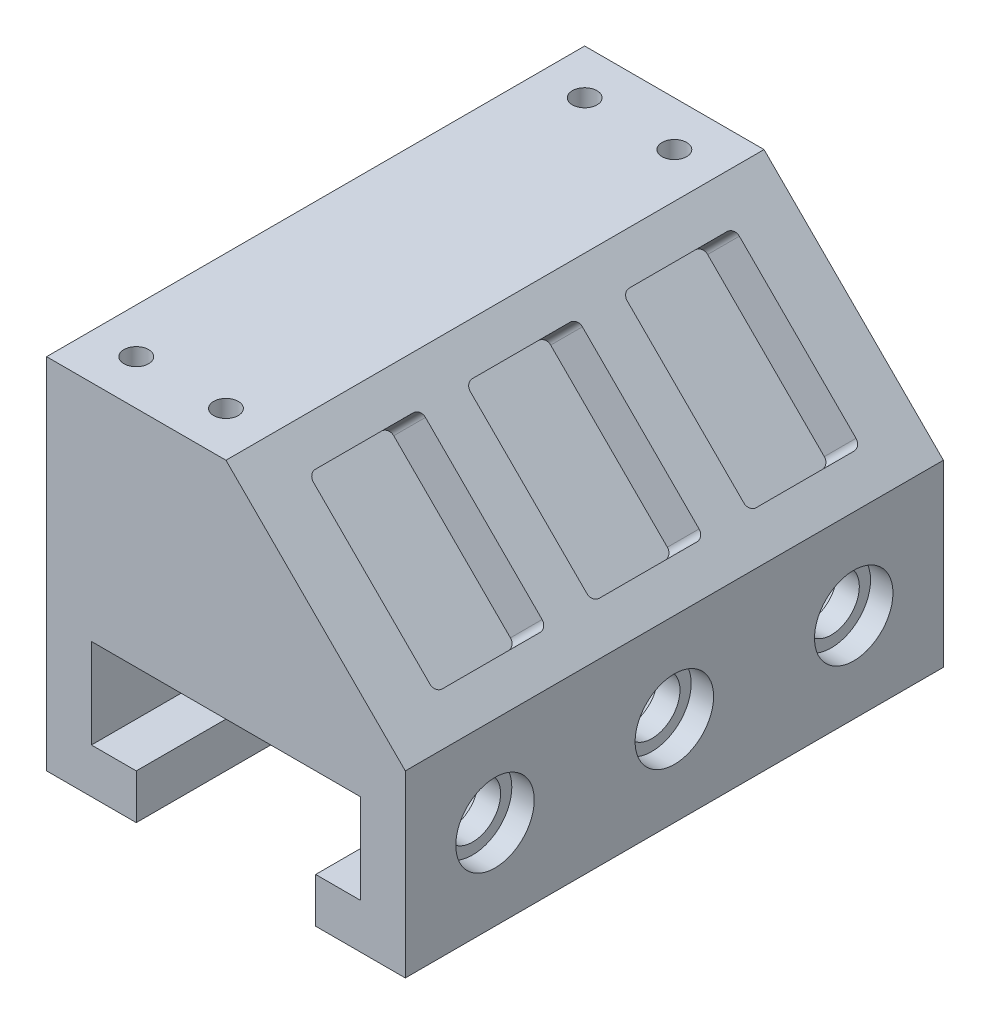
ISO-10303-21;
HEADER;
FILE_DESCRIPTION(('STEP AP214'),'2;1');
FILE_NAME('part.step','',(''),(''),'','','');
FILE_SCHEMA(('AUTOMOTIVE_DESIGN { 1 0 10303 214 1 1 1 1 }'));
ENDSEC;
DATA;
#1=APPLICATION_CONTEXT('core data for automotive mechanical design processes');
#2=APPLICATION_PROTOCOL_DEFINITION('international standard','automotive_design',2000,#1);
#3=PRODUCT_CONTEXT('',#1,'mechanical');
#4=PRODUCT('Part','Part','',(#3));
#5=PRODUCT_RELATED_PRODUCT_CATEGORY('part','',(#4));
#6=PRODUCT_DEFINITION_FORMATION('','',#4);
#7=PRODUCT_DEFINITION_CONTEXT('part definition',#1,'design');
#8=PRODUCT_DEFINITION('design','',#6,#7);
#9=PRODUCT_DEFINITION_SHAPE('','',#8);
#10=(LENGTH_UNIT() NAMED_UNIT(*) SI_UNIT(.MILLI.,.METRE.));
#11=(NAMED_UNIT(*) PLANE_ANGLE_UNIT() SI_UNIT($,.RADIAN.));
#12=(NAMED_UNIT(*) SI_UNIT($,.STERADIAN.) SOLID_ANGLE_UNIT());
#13=UNCERTAINTY_MEASURE_WITH_UNIT(LENGTH_MEASURE(1.E-05),#10,'distance_accuracy_value','');
#14=(GEOMETRIC_REPRESENTATION_CONTEXT(3) GLOBAL_UNCERTAINTY_ASSIGNED_CONTEXT((#13)) GLOBAL_UNIT_ASSIGNED_CONTEXT((#10,
#11,#12)) REPRESENTATION_CONTEXT('',''));
#15=CARTESIAN_POINT('',(0.,0.,0.));
#16=DIRECTION('',(0.,0.,1.));
#17=DIRECTION('',(1.,0.,0.));
#18=AXIS2_PLACEMENT_3D('',#15,#16,#17);
#19=CARTESIAN_POINT('',(25.4,0.,-152.4));
#20=DIRECTION('',(0.,-1.,0.));
#21=DIRECTION('',(1.,0.,0.));
#22=AXIS2_PLACEMENT_3D('',#19,#20,#21);
#23=PLANE('',#22);
#24=DIRECTION('',(1.,0.,0.));
#25=VECTOR('',#24,1.);
#26=CARTESIAN_POINT('',(25.4,0.,0.));
#27=LINE('',#26,#25);
#28=CARTESIAN_POINT('',(0.,0.,0.));
#29=VERTEX_POINT('',#28);
#30=CARTESIAN_POINT('',(25.4,0.,0.));
#31=VERTEX_POINT('',#30);
#32=EDGE_CURVE('E461',#29,#31,#27,.T.);
#33=ORIENTED_EDGE('',*,*,#32,.F.);
#34=DIRECTION('',(0.,0.,1.));
#35=VECTOR('',#34,1.);
#36=CARTESIAN_POINT('',(0.,0.,-152.4));
#37=LINE('',#36,#35);
#38=CARTESIAN_POINT('',(0.,0.,-152.4));
#39=VERTEX_POINT('',#38);
#40=EDGE_CURVE('E554',#39,#29,#37,.T.);
#41=ORIENTED_EDGE('',*,*,#40,.F.);
#42=DIRECTION('',(1.,0.,0.));
#43=VECTOR('',#42,1.);
#44=CARTESIAN_POINT('',(25.4,0.,-152.4));
#45=LINE('',#44,#43);
#46=CARTESIAN_POINT('',(25.4,0.,-152.4));
#47=VERTEX_POINT('',#46);
#48=EDGE_CURVE('E476',#39,#47,#45,.T.);
#49=ORIENTED_EDGE('',*,*,#48,.T.);
#50=DIRECTION('',(0.,0.,1.));
#51=VECTOR('',#50,1.);
#52=CARTESIAN_POINT('',(25.4,0.,-152.4));
#53=LINE('',#52,#51);
#54=EDGE_CURVE('E516',#47,#31,#53,.T.);
#55=ORIENTED_EDGE('',*,*,#54,.T.);
#56=EDGE_LOOP('',(#33,#41,#49,#55));
#57=FACE_BOUND('',#56,.T.);
#58=ADVANCED_FACE('F37',(#57),#23,.T.);
#59=CARTESIAN_POINT('',(0.,0.,-152.4));
#60=DIRECTION('',(-1.,0.,0.));
#61=DIRECTION('',(0.,-1.,0.));
#62=AXIS2_PLACEMENT_3D('',#59,#60,#61);
#63=PLANE('',#62);
#64=CARTESIAN_POINT('',(0.,25.4,-127.));
#65=DIRECTION('',(-1.,0.,0.));
#66=DIRECTION('',(0.,0.,1.));
#67=AXIS2_PLACEMENT_3D('',#64,#65,#66);
#68=CIRCLE('',#67,11.1125);
#69=CARTESIAN_POINT('',(0.,25.4,-115.8875));
#70=VERTEX_POINT('',#69);
#71=EDGE_CURVE('E1282',#70,#70,#68,.T.);
#72=ORIENTED_EDGE('',*,*,#71,.F.);
#73=EDGE_LOOP('',(#72));
#74=FACE_BOUND('',#73,.T.);
#75=CARTESIAN_POINT('',(0.,25.4,-76.2));
#76=DIRECTION('',(-1.,0.,0.));
#77=DIRECTION('',(0.,0.,1.));
#78=AXIS2_PLACEMENT_3D('',#75,#76,#77);
#79=CIRCLE('',#78,11.1125);
#80=CARTESIAN_POINT('',(0.,25.4,-65.0875));
#81=VERTEX_POINT('',#80);
#82=EDGE_CURVE('E1296',#81,#81,#79,.T.);
#83=ORIENTED_EDGE('',*,*,#82,.F.);
#84=EDGE_LOOP('',(#83));
#85=FACE_BOUND('',#84,.T.);
#86=CARTESIAN_POINT('',(0.,25.4,-25.4));
#87=DIRECTION('',(-1.,0.,0.));
#88=DIRECTION('',(0.,0.,1.));
#89=AXIS2_PLACEMENT_3D('',#86,#87,#88);
#90=CIRCLE('',#89,11.1125);
#91=CARTESIAN_POINT('',(0.,25.4,-14.2875));
#92=VERTEX_POINT('',#91);
#93=EDGE_CURVE('E1305',#92,#92,#90,.T.);
#94=ORIENTED_EDGE('',*,*,#93,.F.);
#95=EDGE_LOOP('',(#94));
#96=FACE_BOUND('',#95,.T.);
#97=DIRECTION('',(0.,-1.,0.));
#98=VECTOR('',#97,1.);
#99=CARTESIAN_POINT('',(0.,0.,0.));
#100=LINE('',#99,#98);
#101=CARTESIAN_POINT('',(0.,101.6,0.));
#102=VERTEX_POINT('',#101);
#103=EDGE_CURVE('E480',#102,#29,#100,.T.);
#104=ORIENTED_EDGE('',*,*,#103,.F.);
#105=DIRECTION('',(0.,0.,1.));
#106=VECTOR('',#105,1.);
#107=CARTESIAN_POINT('',(0.,101.6,-152.4));
#108=LINE('',#107,#106);
#109=CARTESIAN_POINT('',(0.,101.6,-152.4));
#110=VERTEX_POINT('',#109);
#111=EDGE_CURVE('E557',#110,#102,#108,.T.);
#112=ORIENTED_EDGE('',*,*,#111,.F.);
#113=DIRECTION('',(0.,-1.,0.));
#114=VECTOR('',#113,1.);
#115=CARTESIAN_POINT('',(0.,0.,-152.4));
#116=LINE('',#115,#114);
#117=EDGE_CURVE('E513',#110,#39,#116,.T.);
#118=ORIENTED_EDGE('',*,*,#117,.T.);
#119=ORIENTED_EDGE('',*,*,#40,.T.);
#120=EDGE_LOOP('',(#104,#112,#118,#119));
#121=FACE_BOUND('',#120,.T.);
#122=ADVANCED_FACE('F621',(#74,#85,#96,#121),#63,.T.);
#123=CARTESIAN_POINT('',(0.,101.6,-152.4));
#124=DIRECTION('',(0.,1.,0.));
#125=DIRECTION('',(0.,0.,1.));
#126=AXIS2_PLACEMENT_3D('',#123,#124,#125);
#127=PLANE('',#126);
#128=CARTESIAN_POINT('',(12.7,101.6,-139.7));
#129=DIRECTION('',(0.,1.,0.));
#130=DIRECTION('',(0.,0.,1.));
#131=AXIS2_PLACEMENT_3D('',#128,#129,#130);
#132=CIRCLE('',#131,3.4925);
#133=CARTESIAN_POINT('',(12.7,101.6,-136.2075));
#134=VERTEX_POINT('',#133);
#135=EDGE_CURVE('E1229',#134,#134,#132,.T.);
#136=ORIENTED_EDGE('',*,*,#135,.F.);
#137=EDGE_LOOP('',(#136));
#138=FACE_BOUND('',#137,.T.);
#139=CARTESIAN_POINT('',(38.1,101.6,-139.7));
#140=DIRECTION('',(0.,1.,0.));
#141=DIRECTION('',(0.,0.,1.));
#142=AXIS2_PLACEMENT_3D('',#139,#140,#141);
#143=CIRCLE('',#142,3.4925);
#144=CARTESIAN_POINT('',(38.1,101.6,-136.2075));
#145=VERTEX_POINT('',#144);
#146=EDGE_CURVE('E1233',#145,#145,#143,.T.);
#147=ORIENTED_EDGE('',*,*,#146,.F.);
#148=EDGE_LOOP('',(#147));
#149=FACE_BOUND('',#148,.T.);
#150=CARTESIAN_POINT('',(38.1,101.6,-12.7));
#151=DIRECTION('',(0.,1.,0.));
#152=DIRECTION('',(0.,0.,1.));
#153=AXIS2_PLACEMENT_3D('',#150,#151,#152);
#154=CIRCLE('',#153,3.4925);
#155=CARTESIAN_POINT('',(38.1,101.6,-9.2075));
#156=VERTEX_POINT('',#155);
#157=EDGE_CURVE('E1237',#156,#156,#154,.T.);
#158=ORIENTED_EDGE('',*,*,#157,.F.);
#159=EDGE_LOOP('',(#158));
#160=FACE_BOUND('',#159,.T.);
#161=CARTESIAN_POINT('',(12.7,101.6,-12.7));
#162=DIRECTION('',(0.,1.,0.));
#163=DIRECTION('',(0.,0.,1.));
#164=AXIS2_PLACEMENT_3D('',#161,#162,#163);
#165=CIRCLE('',#164,3.4925);
#166=CARTESIAN_POINT('',(12.7,101.6,-9.20749999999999));
#167=VERTEX_POINT('',#166);
#168=EDGE_CURVE('E1241',#167,#167,#165,.T.);
#169=ORIENTED_EDGE('',*,*,#168,.F.);
#170=EDGE_LOOP('',(#169));
#171=FACE_BOUND('',#170,.T.);
#172=DIRECTION('',(-1.,0.,0.));
#173=VECTOR('',#172,1.);
#174=CARTESIAN_POINT('',(0.,101.6,0.));
#175=LINE('',#174,#173);
#176=CARTESIAN_POINT('',(50.8,101.6,0.));
#177=VERTEX_POINT('',#176);
#178=EDGE_CURVE('E549',#177,#102,#175,.T.);
#179=ORIENTED_EDGE('',*,*,#178,.F.);
#180=DIRECTION('',(0.,0.,1.));
#181=VECTOR('',#180,1.);
#182=CARTESIAN_POINT('',(50.8,101.6,-152.4));
#183=LINE('',#182,#181);
#184=CARTESIAN_POINT('',(50.8,101.6,-152.4));
#185=VERTEX_POINT('',#184);
#186=EDGE_CURVE('E559',#185,#177,#183,.T.);
#187=ORIENTED_EDGE('',*,*,#186,.F.);
#188=DIRECTION('',(-1.,0.,0.));
#189=VECTOR('',#188,1.);
#190=CARTESIAN_POINT('',(0.,101.6,-152.4));
#191=LINE('',#190,#189);
#192=EDGE_CURVE('E510',#185,#110,#191,.T.);
#193=ORIENTED_EDGE('',*,*,#192,.T.);
#194=ORIENTED_EDGE('',*,*,#111,.T.);
#195=EDGE_LOOP('',(#179,#187,#193,#194));
#196=FACE_BOUND('',#195,.T.);
#197=ADVANCED_FACE('F615',(#138,#149,#160,#171,#196),#127,.T.);
#198=CARTESIAN_POINT('',(50.8,101.6,-152.4));
#199=DIRECTION('',(0.707106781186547,0.707106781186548,0.));
#200=DIRECTION('',(-0.707106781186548,0.707106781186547,0.));
#201=AXIS2_PLACEMENT_3D('',#198,#199,#200);
#202=PLANE('',#201);
#203=CARTESIAN_POINT('',(92.7236712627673,59.6763287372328,-17.907));
#204=DIRECTION('',(0.707106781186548,0.707106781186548,0.));
#205=DIRECTION('',(0.707106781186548,-0.707106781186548,0.));
#206=AXIS2_PLACEMENT_3D('',#203,#204,#205);
#207=CIRCLE('',#206,2.032);
#208=CARTESIAN_POINT('',(92.7236712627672,59.6763287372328,-15.875));
#209=VERTEX_POINT('',#208);
#210=CARTESIAN_POINT('',(94.1605122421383,58.2394877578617,-17.907));
#211=VERTEX_POINT('',#210);
#212=EDGE_CURVE('E52',#209,#211,#207,.T.);
#213=ORIENTED_EDGE('',*,*,#212,.F.);
#214=DIRECTION('',(0.707106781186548,-0.707106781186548,0.));
#215=VECTOR('',#214,1.);
#216=CARTESIAN_POINT('',(92.7236712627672,59.6763287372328,-15.875));
#217=LINE('',#216,#215);
#218=CARTESIAN_POINT('',(59.6763287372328,92.7236712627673,-15.875));
#219=VERTEX_POINT('',#218);
#220=EDGE_CURVE('E297',#219,#209,#217,.T.);
#221=ORIENTED_EDGE('',*,*,#220,.F.);
#222=CARTESIAN_POINT('',(59.6763287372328,92.7236712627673,-17.907));
#223=DIRECTION('',(0.707106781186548,0.707106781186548,0.));
#224=DIRECTION('',(0.707106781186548,-0.707106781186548,0.));
#225=AXIS2_PLACEMENT_3D('',#222,#223,#224);
#226=CIRCLE('',#225,2.032);
#227=CARTESIAN_POINT('',(58.2394877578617,94.1605122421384,-17.907));
#228=VERTEX_POINT('',#227);
#229=EDGE_CURVE('E300',#228,#219,#226,.T.);
#230=ORIENTED_EDGE('',*,*,#229,.F.);
#231=DIRECTION('',(0.,0.,1.));
#232=VECTOR('',#231,1.);
#233=CARTESIAN_POINT('',(58.2394877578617,94.1605122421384,-17.907));
#234=LINE('',#233,#232);
#235=CARTESIAN_POINT('',(58.2394877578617,94.1605122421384,-45.593));
#236=VERTEX_POINT('',#235);
#237=EDGE_CURVE('E331',#236,#228,#234,.T.);
#238=ORIENTED_EDGE('',*,*,#237,.F.);
#239=CARTESIAN_POINT('',(59.6763287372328,92.7236712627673,-45.593));
#240=DIRECTION('',(0.707106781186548,0.707106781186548,0.));
#241=DIRECTION('',(0.707106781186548,-0.707106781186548,0.));
#242=AXIS2_PLACEMENT_3D('',#239,#240,#241);
#243=CIRCLE('',#242,2.032);
#244=CARTESIAN_POINT('',(59.6763287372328,92.7236712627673,-47.625));
#245=VERTEX_POINT('',#244);
#246=EDGE_CURVE('E328',#245,#236,#243,.T.);
#247=ORIENTED_EDGE('',*,*,#246,.F.);
#248=DIRECTION('',(-0.707106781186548,0.707106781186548,0.));
#249=VECTOR('',#248,1.);
#250=CARTESIAN_POINT('',(92.7236712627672,59.6763287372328,-47.625));
#251=LINE('',#250,#249);
#252=CARTESIAN_POINT('',(92.7236712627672,59.6763287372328,-47.625));
#253=VERTEX_POINT('',#252);
#254=EDGE_CURVE('E325',#253,#245,#251,.T.);
#255=ORIENTED_EDGE('',*,*,#254,.F.);
#256=CARTESIAN_POINT('',(92.7236712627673,59.6763287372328,-45.593));
#257=DIRECTION('',(0.707106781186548,0.707106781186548,0.));
#258=DIRECTION('',(-0.707106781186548,0.707106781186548,0.));
#259=AXIS2_PLACEMENT_3D('',#256,#257,#258);
#260=CIRCLE('',#259,2.032);
#261=CARTESIAN_POINT('',(94.1605122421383,58.2394877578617,-45.593));
#262=VERTEX_POINT('',#261);
#263=EDGE_CURVE('E322',#262,#253,#260,.T.);
#264=ORIENTED_EDGE('',*,*,#263,.F.);
#265=DIRECTION('',(0.,0.,-1.));
#266=VECTOR('',#265,1.);
#267=CARTESIAN_POINT('',(94.1605122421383,58.2394877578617,-17.907));
#268=LINE('',#267,#266);
#269=EDGE_CURVE('E320',#211,#262,#268,.T.);
#270=ORIENTED_EDGE('',*,*,#269,.F.);
#271=EDGE_LOOP('',(#213,#221,#230,#238,#247,#255,#264,#270));
#272=FACE_BOUND('',#271,.T.);
#273=CARTESIAN_POINT('',(59.6763287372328,92.7236712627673,-62.357));
#274=DIRECTION('',(0.707106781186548,0.707106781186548,0.));
#275=DIRECTION('',(0.707106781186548,-0.707106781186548,0.));
#276=AXIS2_PLACEMENT_3D('',#273,#274,#275);
#277=CIRCLE('',#276,2.032);
#278=CARTESIAN_POINT('',(58.2394877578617,94.1605122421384,-62.357));
#279=VERTEX_POINT('',#278);
#280=CARTESIAN_POINT('',(59.6763287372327,92.7236712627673,-60.325));
#281=VERTEX_POINT('',#280);
#282=EDGE_CURVE('E60',#279,#281,#277,.T.);
#283=ORIENTED_EDGE('',*,*,#282,.F.);
#284=DIRECTION('',(0.,0.,1.));
#285=VECTOR('',#284,1.);
#286=CARTESIAN_POINT('',(58.2394877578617,94.1605122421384,-62.357));
#287=LINE('',#286,#285);
#288=CARTESIAN_POINT('',(58.2394877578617,94.1605122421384,-90.043));
#289=VERTEX_POINT('',#288);
#290=EDGE_CURVE('E353',#289,#279,#287,.T.);
#291=ORIENTED_EDGE('',*,*,#290,.F.);
#292=CARTESIAN_POINT('',(59.6763287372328,92.7236712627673,-90.043));
#293=DIRECTION('',(0.707106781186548,0.707106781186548,0.));
#294=DIRECTION('',(-0.707106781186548,0.707106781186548,0.));
#295=AXIS2_PLACEMENT_3D('',#292,#293,#294);
#296=CIRCLE('',#295,2.032);
#297=CARTESIAN_POINT('',(59.6763287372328,92.7236712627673,-92.075));
#298=VERTEX_POINT('',#297);
#299=EDGE_CURVE('E391',#298,#289,#296,.T.);
#300=ORIENTED_EDGE('',*,*,#299,.F.);
#301=DIRECTION('',(-0.707106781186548,0.707106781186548,0.));
#302=VECTOR('',#301,1.);
#303=CARTESIAN_POINT('',(92.7236712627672,59.6763287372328,-92.075));
#304=LINE('',#303,#302);
#305=CARTESIAN_POINT('',(92.7236712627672,59.6763287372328,-92.075));
#306=VERTEX_POINT('',#305);
#307=EDGE_CURVE('E388',#306,#298,#304,.T.);
#308=ORIENTED_EDGE('',*,*,#307,.F.);
#309=CARTESIAN_POINT('',(92.7236712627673,59.6763287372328,-90.043));
#310=DIRECTION('',(0.707106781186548,0.707106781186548,0.));
#311=DIRECTION('',(-0.707106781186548,0.707106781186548,0.));
#312=AXIS2_PLACEMENT_3D('',#309,#310,#311);
#313=CIRCLE('',#312,2.032);
#314=CARTESIAN_POINT('',(94.1605122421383,58.2394877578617,-90.043));
#315=VERTEX_POINT('',#314);
#316=EDGE_CURVE('E385',#315,#306,#313,.T.);
#317=ORIENTED_EDGE('',*,*,#316,.F.);
#318=DIRECTION('',(0.,0.,-1.));
#319=VECTOR('',#318,1.);
#320=CARTESIAN_POINT('',(94.1605122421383,58.2394877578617,-62.357));
#321=LINE('',#320,#319);
#322=CARTESIAN_POINT('',(94.1605122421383,58.2394877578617,-62.357));
#323=VERTEX_POINT('',#322);
#324=EDGE_CURVE('E382',#323,#315,#321,.T.);
#325=ORIENTED_EDGE('',*,*,#324,.F.);
#326=CARTESIAN_POINT('',(92.7236712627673,59.6763287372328,-62.357));
#327=DIRECTION('',(0.707106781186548,0.707106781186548,0.));
#328=DIRECTION('',(-0.707106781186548,0.707106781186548,0.));
#329=AXIS2_PLACEMENT_3D('',#326,#327,#328);
#330=CIRCLE('',#329,2.032);
#331=CARTESIAN_POINT('',(92.7236712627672,59.6763287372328,-60.325));
#332=VERTEX_POINT('',#331);
#333=EDGE_CURVE('E379',#332,#323,#330,.T.);
#334=ORIENTED_EDGE('',*,*,#333,.F.);
#335=DIRECTION('',(0.707106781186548,-0.707106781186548,0.));
#336=VECTOR('',#335,1.);
#337=CARTESIAN_POINT('',(92.7236712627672,59.6763287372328,-60.325));
#338=LINE('',#337,#336);
#339=EDGE_CURVE('E376',#281,#332,#338,.T.);
#340=ORIENTED_EDGE('',*,*,#339,.F.);
#341=EDGE_LOOP('',(#283,#291,#300,#308,#317,#325,#334,#340));
#342=FACE_BOUND('',#341,.T.);
#343=CARTESIAN_POINT('',(59.6763287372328,92.7236712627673,-134.493));
#344=DIRECTION('',(0.707106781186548,0.707106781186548,0.));
#345=DIRECTION('',(-0.707106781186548,0.707106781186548,0.));
#346=AXIS2_PLACEMENT_3D('',#343,#344,#345);
#347=CIRCLE('',#346,2.032);
#348=CARTESIAN_POINT('',(59.6763287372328,92.7236712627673,-136.525));
#349=VERTEX_POINT('',#348);
#350=CARTESIAN_POINT('',(58.2394877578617,94.1605122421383,-134.493));
#351=VERTEX_POINT('',#350);
#352=EDGE_CURVE('E398',#349,#351,#347,.T.);
#353=ORIENTED_EDGE('',*,*,#352,.F.);
#354=DIRECTION('',(-0.707106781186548,0.707106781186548,0.));
#355=VECTOR('',#354,1.);
#356=CARTESIAN_POINT('',(92.7236712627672,59.6763287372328,-136.525));
#357=LINE('',#356,#355);
#358=CARTESIAN_POINT('',(92.7236712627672,59.6763287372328,-136.525));
#359=VERTEX_POINT('',#358);
#360=EDGE_CURVE('E416',#359,#349,#357,.T.);
#361=ORIENTED_EDGE('',*,*,#360,.F.);
#362=CARTESIAN_POINT('',(92.7236712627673,59.6763287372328,-134.493));
#363=DIRECTION('',(0.707106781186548,0.707106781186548,0.));
#364=DIRECTION('',(-0.707106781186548,0.707106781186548,0.));
#365=AXIS2_PLACEMENT_3D('',#362,#363,#364);
#366=CIRCLE('',#365,2.032);
#367=CARTESIAN_POINT('',(94.1605122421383,58.2394877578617,-134.493));
#368=VERTEX_POINT('',#367);
#369=EDGE_CURVE('E454',#368,#359,#366,.T.);
#370=ORIENTED_EDGE('',*,*,#369,.F.);
#371=DIRECTION('',(0.,0.,-1.));
#372=VECTOR('',#371,1.);
#373=CARTESIAN_POINT('',(94.1605122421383,58.2394877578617,-106.807));
#374=LINE('',#373,#372);
#375=CARTESIAN_POINT('',(94.1605122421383,58.2394877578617,-106.807));
#376=VERTEX_POINT('',#375);
#377=EDGE_CURVE('E451',#376,#368,#374,.T.);
#378=ORIENTED_EDGE('',*,*,#377,.F.);
#379=CARTESIAN_POINT('',(92.7236712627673,59.6763287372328,-106.807));
#380=DIRECTION('',(0.707106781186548,0.707106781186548,0.));
#381=DIRECTION('',(-0.707106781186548,0.707106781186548,0.));
#382=AXIS2_PLACEMENT_3D('',#379,#380,#381);
#383=CIRCLE('',#382,2.032);
#384=CARTESIAN_POINT('',(92.7236712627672,59.6763287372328,-104.775));
#385=VERTEX_POINT('',#384);
#386=EDGE_CURVE('E448',#385,#376,#383,.T.);
#387=ORIENTED_EDGE('',*,*,#386,.F.);
#388=DIRECTION('',(0.707106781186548,-0.707106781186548,0.));
#389=VECTOR('',#388,1.);
#390=CARTESIAN_POINT('',(92.7236712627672,59.6763287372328,-104.775));
#391=LINE('',#390,#389);
#392=CARTESIAN_POINT('',(59.6763287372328,92.7236712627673,-104.775));
#393=VERTEX_POINT('',#392);
#394=EDGE_CURVE('E445',#393,#385,#391,.T.);
#395=ORIENTED_EDGE('',*,*,#394,.F.);
#396=CARTESIAN_POINT('',(59.6763287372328,92.7236712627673,-106.807));
#397=DIRECTION('',(0.707106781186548,0.707106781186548,0.));
#398=DIRECTION('',(0.707106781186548,-0.707106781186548,0.));
#399=AXIS2_PLACEMENT_3D('',#396,#397,#398);
#400=CIRCLE('',#399,2.032);
#401=CARTESIAN_POINT('',(58.2394877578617,94.1605122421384,-106.807));
#402=VERTEX_POINT('',#401);
#403=EDGE_CURVE('E442',#402,#393,#400,.T.);
#404=ORIENTED_EDGE('',*,*,#403,.F.);
#405=DIRECTION('',(0.,0.,1.));
#406=VECTOR('',#405,1.);
#407=CARTESIAN_POINT('',(58.2394877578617,94.1605122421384,-106.807));
#408=LINE('',#407,#406);
#409=EDGE_CURVE('E439',#351,#402,#408,.T.);
#410=ORIENTED_EDGE('',*,*,#409,.F.);
#411=EDGE_LOOP('',(#353,#361,#370,#378,#387,#395,#404,#410));
#412=FACE_BOUND('',#411,.T.);
#413=DIRECTION('',(-0.707106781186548,0.707106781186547,0.));
#414=VECTOR('',#413,1.);
#415=CARTESIAN_POINT('',(50.8,101.6,0.));
#416=LINE('',#415,#414);
#417=CARTESIAN_POINT('',(101.6,50.8,0.));
#418=VERTEX_POINT('',#417);
#419=EDGE_CURVE('E546',#418,#177,#416,.T.);
#420=ORIENTED_EDGE('',*,*,#419,.F.);
#421=DIRECTION('',(0.,0.,1.));
#422=VECTOR('',#421,1.);
#423=CARTESIAN_POINT('',(101.6,50.8,-152.4));
#424=LINE('',#423,#422);
#425=CARTESIAN_POINT('',(101.6,50.8,-152.4));
#426=VERTEX_POINT('',#425);
#427=EDGE_CURVE('E561',#426,#418,#424,.T.);
#428=ORIENTED_EDGE('',*,*,#427,.F.);
#429=DIRECTION('',(-0.707106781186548,0.707106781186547,0.));
#430=VECTOR('',#429,1.);
#431=CARTESIAN_POINT('',(50.8,101.6,-152.4));
#432=LINE('',#431,#430);
#433=EDGE_CURVE('E507',#426,#185,#432,.T.);
#434=ORIENTED_EDGE('',*,*,#433,.T.);
#435=ORIENTED_EDGE('',*,*,#186,.T.);
#436=EDGE_LOOP('',(#420,#428,#434,#435));
#437=FACE_BOUND('',#436,.T.);
#438=ADVANCED_FACE('F605',(#272,#342,#412,#437),#202,.T.);
#439=CARTESIAN_POINT('',(101.6,50.8,-152.4));
#440=DIRECTION('',(1.,0.,0.));
#441=DIRECTION('',(0.,0.,-1.));
#442=AXIS2_PLACEMENT_3D('',#439,#440,#441);
#443=PLANE('',#442);
#444=CARTESIAN_POINT('',(101.6,25.4,-76.2));
#445=DIRECTION('',(1.,0.,0.));
#446=DIRECTION('',(0.,0.,-1.));
#447=AXIS2_PLACEMENT_3D('',#444,#445,#446);
#448=CIRCLE('',#447,11.1125);
#449=CARTESIAN_POINT('',(101.6,25.4,-87.3125));
#450=VERTEX_POINT('',#449);
#451=EDGE_CURVE('E1317',#450,#450,#448,.T.);
#452=ORIENTED_EDGE('',*,*,#451,.F.);
#453=EDGE_LOOP('',(#452));
#454=FACE_BOUND('',#453,.T.);
#455=CARTESIAN_POINT('',(101.6,25.4,-25.4));
#456=DIRECTION('',(1.,0.,0.));
#457=DIRECTION('',(0.,0.,-1.));
#458=AXIS2_PLACEMENT_3D('',#455,#456,#457);
#459=CIRCLE('',#458,11.1125);
#460=CARTESIAN_POINT('',(101.6,25.4,-36.5125));
#461=VERTEX_POINT('',#460);
#462=EDGE_CURVE('E1329',#461,#461,#459,.T.);
#463=ORIENTED_EDGE('',*,*,#462,.F.);
#464=EDGE_LOOP('',(#463));
#465=FACE_BOUND('',#464,.T.);
#466=DIRECTION('',(0.,1.,0.));
#467=VECTOR('',#466,1.);
#468=CARTESIAN_POINT('',(101.6,50.8,0.));
#469=LINE('',#468,#467);
#470=CARTESIAN_POINT('',(101.6,0.,0.));
#471=VERTEX_POINT('',#470);
#472=EDGE_CURVE('E543',#471,#418,#469,.T.);
#473=ORIENTED_EDGE('',*,*,#472,.F.);
#474=DIRECTION('',(0.,0.,1.));
#475=VECTOR('',#474,1.);
#476=CARTESIAN_POINT('',(101.6,0.,-152.4));
#477=LINE('',#476,#475);
#478=CARTESIAN_POINT('',(101.6,0.,-152.4));
#479=VERTEX_POINT('',#478);
#480=EDGE_CURVE('E563',#479,#471,#477,.T.);
#481=ORIENTED_EDGE('',*,*,#480,.F.);
#482=DIRECTION('',(0.,1.,0.));
#483=VECTOR('',#482,1.);
#484=CARTESIAN_POINT('',(101.6,50.8,-152.4));
#485=LINE('',#484,#483);
#486=EDGE_CURVE('E504',#479,#426,#485,.T.);
#487=ORIENTED_EDGE('',*,*,#486,.T.);
#488=ORIENTED_EDGE('',*,*,#427,.T.);
#489=EDGE_LOOP('',(#473,#481,#487,#488));
#490=FACE_BOUND('',#489,.T.);
#491=CARTESIAN_POINT('',(101.6,25.4,-127.));
#492=DIRECTION('',(1.,0.,0.));
#493=DIRECTION('',(0.,0.,-1.));
#494=AXIS2_PLACEMENT_3D('',#491,#492,#493);
#495=CIRCLE('',#494,11.1125);
#496=CARTESIAN_POINT('',(101.6,25.4,-138.1125));
#497=VERTEX_POINT('',#496);
#498=EDGE_CURVE('E556',#497,#497,#495,.T.);
#499=ORIENTED_EDGE('',*,*,#498,.F.);
#500=EDGE_LOOP('',(#499));
#501=FACE_BOUND('',#500,.T.);
#502=ADVANCED_FACE('F602',(#454,#465,#490,#501),#443,.T.);
#503=CARTESIAN_POINT('',(101.6,0.,-152.4));
#504=DIRECTION('',(0.,-1.,0.));
#505=DIRECTION('',(1.,0.,0.));
#506=AXIS2_PLACEMENT_3D('',#503,#504,#505);
#507=PLANE('',#506);
#508=DIRECTION('',(1.,0.,0.));
#509=VECTOR('',#508,1.);
#510=CARTESIAN_POINT('',(101.6,0.,0.));
#511=LINE('',#510,#509);
#512=CARTESIAN_POINT('',(76.2,0.,0.));
#513=VERTEX_POINT('',#512);
#514=EDGE_CURVE('E540',#513,#471,#511,.T.);
#515=ORIENTED_EDGE('',*,*,#514,.F.);
#516=DIRECTION('',(0.,0.,1.));
#517=VECTOR('',#516,1.);
#518=CARTESIAN_POINT('',(76.2,0.,-152.4));
#519=LINE('',#518,#517);
#520=CARTESIAN_POINT('',(76.2,0.,-152.4));
#521=VERTEX_POINT('',#520);
#522=EDGE_CURVE('E565',#521,#513,#519,.T.);
#523=ORIENTED_EDGE('',*,*,#522,.F.);
#524=DIRECTION('',(1.,0.,0.));
#525=VECTOR('',#524,1.);
#526=CARTESIAN_POINT('',(101.6,0.,-152.4));
#527=LINE('',#526,#525);
#528=EDGE_CURVE('E501',#521,#479,#527,.T.);
#529=ORIENTED_EDGE('',*,*,#528,.T.);
#530=ORIENTED_EDGE('',*,*,#480,.T.);
#531=EDGE_LOOP('',(#515,#523,#529,#530));
#532=FACE_BOUND('',#531,.T.);
#533=ADVANCED_FACE('F604',(#532),#507,.T.);
#534=CARTESIAN_POINT('',(76.2,0.,-152.4));
#535=DIRECTION('',(-1.,0.,0.));
#536=DIRECTION('',(0.,0.,1.));
#537=AXIS2_PLACEMENT_3D('',#534,#535,#536);
#538=PLANE('',#537);
#539=DIRECTION('',(0.,-1.,0.));
#540=VECTOR('',#539,1.);
#541=CARTESIAN_POINT('',(76.2,0.,0.));
#542=LINE('',#541,#540);
#543=CARTESIAN_POINT('',(76.2,12.7,0.));
#544=VERTEX_POINT('',#543);
#545=EDGE_CURVE('E537',#544,#513,#542,.T.);
#546=ORIENTED_EDGE('',*,*,#545,.F.);
#547=DIRECTION('',(0.,0.,1.));
#548=VECTOR('',#547,1.);
#549=CARTESIAN_POINT('',(76.2,12.7,-152.4));
#550=LINE('',#549,#548);
#551=CARTESIAN_POINT('',(76.2,12.7,-152.4));
#552=VERTEX_POINT('',#551);
#553=EDGE_CURVE('E567',#552,#544,#550,.T.);
#554=ORIENTED_EDGE('',*,*,#553,.F.);
#555=DIRECTION('',(0.,-1.,0.));
#556=VECTOR('',#555,1.);
#557=CARTESIAN_POINT('',(76.2,0.,-152.4));
#558=LINE('',#557,#556);
#559=EDGE_CURVE('E498',#552,#521,#558,.T.);
#560=ORIENTED_EDGE('',*,*,#559,.T.);
#561=ORIENTED_EDGE('',*,*,#522,.T.);
#562=EDGE_LOOP('',(#546,#554,#560,#561));
#563=FACE_BOUND('',#562,.T.);
#564=ADVANCED_FACE('F612',(#563),#538,.T.);
#565=CARTESIAN_POINT('',(76.2,12.7,-152.4));
#566=DIRECTION('',(0.,1.,0.));
#567=DIRECTION('',(0.,0.,1.));
#568=AXIS2_PLACEMENT_3D('',#565,#566,#567);
#569=PLANE('',#568);
#570=DIRECTION('',(-1.,0.,0.));
#571=VECTOR('',#570,1.);
#572=CARTESIAN_POINT('',(76.2,12.7,0.));
#573=LINE('',#572,#571);
#574=CARTESIAN_POINT('',(88.9,12.7,0.));
#575=VERTEX_POINT('',#574);
#576=EDGE_CURVE('E534',#575,#544,#573,.T.);
#577=ORIENTED_EDGE('',*,*,#576,.F.);
#578=DIRECTION('',(0.,0.,1.));
#579=VECTOR('',#578,1.);
#580=CARTESIAN_POINT('',(88.9,12.7,-152.4));
#581=LINE('',#580,#579);
#582=CARTESIAN_POINT('',(88.9,12.7,-152.4));
#583=VERTEX_POINT('',#582);
#584=EDGE_CURVE('E569',#583,#575,#581,.T.);
#585=ORIENTED_EDGE('',*,*,#584,.F.);
#586=DIRECTION('',(-1.,0.,0.));
#587=VECTOR('',#586,1.);
#588=CARTESIAN_POINT('',(76.2,12.7,-152.4));
#589=LINE('',#588,#587);
#590=EDGE_CURVE('E495',#583,#552,#589,.T.);
#591=ORIENTED_EDGE('',*,*,#590,.T.);
#592=ORIENTED_EDGE('',*,*,#553,.T.);
#593=EDGE_LOOP('',(#577,#585,#591,#592));
#594=FACE_BOUND('',#593,.T.);
#595=ADVANCED_FACE('F1177',(#594),#569,.T.);
#596=CARTESIAN_POINT('',(88.9,12.7,-152.4));
#597=DIRECTION('',(-1.,0.,0.));
#598=DIRECTION('',(0.,-1.,0.));
#599=AXIS2_PLACEMENT_3D('',#596,#597,#598);
#600=PLANE('',#599);
#601=CARTESIAN_POINT('',(88.9,25.4,-76.2));
#602=DIRECTION('',(-1.,0.,0.));
#603=DIRECTION('',(0.,-1.,0.));
#604=AXIS2_PLACEMENT_3D('',#601,#602,#603);
#605=CIRCLE('',#604,7.93749999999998);
#606=CARTESIAN_POINT('',(88.9,17.4625,-76.2));
#607=VERTEX_POINT('',#606);
#608=EDGE_CURVE('E1320',#607,#607,#605,.T.);
#609=ORIENTED_EDGE('',*,*,#608,.F.);
#610=EDGE_LOOP('',(#609));
#611=FACE_BOUND('',#610,.T.);
#612=CARTESIAN_POINT('',(88.9,25.4,-25.4));
#613=DIRECTION('',(-1.,0.,0.));
#614=DIRECTION('',(0.,-1.,0.));
#615=AXIS2_PLACEMENT_3D('',#612,#613,#614);
#616=CIRCLE('',#615,7.93749999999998);
#617=CARTESIAN_POINT('',(88.9,17.4625,-25.4));
#618=VERTEX_POINT('',#617);
#619=EDGE_CURVE('E303',#618,#618,#616,.T.);
#620=ORIENTED_EDGE('',*,*,#619,.F.);
#621=EDGE_LOOP('',(#620));
#622=FACE_BOUND('',#621,.T.);
#623=DIRECTION('',(0.,-1.,0.));
#624=VECTOR('',#623,1.);
#625=CARTESIAN_POINT('',(88.9,12.7,0.));
#626=LINE('',#625,#624);
#627=CARTESIAN_POINT('',(88.9,38.1,0.));
#628=VERTEX_POINT('',#627);
#629=EDGE_CURVE('E531',#628,#575,#626,.T.);
#630=ORIENTED_EDGE('',*,*,#629,.F.);
#631=DIRECTION('',(0.,0.,1.));
#632=VECTOR('',#631,1.);
#633=CARTESIAN_POINT('',(88.9,38.1,-152.4));
#634=LINE('',#633,#632);
#635=CARTESIAN_POINT('',(88.9,38.1,-152.4));
#636=VERTEX_POINT('',#635);
#637=EDGE_CURVE('E571',#636,#628,#634,.T.);
#638=ORIENTED_EDGE('',*,*,#637,.F.);
#639=DIRECTION('',(0.,-1.,0.));
#640=VECTOR('',#639,1.);
#641=CARTESIAN_POINT('',(88.9,12.7,-152.4));
#642=LINE('',#641,#640);
#643=EDGE_CURVE('E492',#636,#583,#642,.T.);
#644=ORIENTED_EDGE('',*,*,#643,.T.);
#645=ORIENTED_EDGE('',*,*,#584,.T.);
#646=EDGE_LOOP('',(#630,#638,#644,#645));
#647=FACE_BOUND('',#646,.T.);
#648=CARTESIAN_POINT('',(88.9,25.4,-127.));
#649=DIRECTION('',(-1.,0.,0.));
#650=DIRECTION('',(0.,-1.,0.));
#651=AXIS2_PLACEMENT_3D('',#648,#649,#650);
#652=CIRCLE('',#651,7.93749999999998);
#653=CARTESIAN_POINT('',(88.9,17.4625,-127.));
#654=VERTEX_POINT('',#653);
#655=EDGE_CURVE('E586',#654,#654,#652,.T.);
#656=ORIENTED_EDGE('',*,*,#655,.F.);
#657=EDGE_LOOP('',(#656));
#658=FACE_BOUND('',#657,.T.);
#659=ADVANCED_FACE('F1168',(#611,#622,#647,#658),#600,.T.);
#660=CARTESIAN_POINT('',(88.9,38.1,-152.4));
#661=DIRECTION('',(0.,-1.,0.));
#662=DIRECTION('',(0.,0.,-1.));
#663=AXIS2_PLACEMENT_3D('',#660,#661,#662);
#664=PLANE('',#663);
#665=DIRECTION('',(1.,0.,0.));
#666=VECTOR('',#665,1.);
#667=CARTESIAN_POINT('',(88.9,38.1,0.));
#668=LINE('',#667,#666);
#669=CARTESIAN_POINT('',(12.7,38.1,0.));
#670=VERTEX_POINT('',#669);
#671=EDGE_CURVE('E528',#670,#628,#668,.T.);
#672=ORIENTED_EDGE('',*,*,#671,.F.);
#673=DIRECTION('',(0.,0.,1.));
#674=VECTOR('',#673,1.);
#675=CARTESIAN_POINT('',(12.7,38.1,-152.4));
#676=LINE('',#675,#674);
#677=CARTESIAN_POINT('',(12.7,38.1,-152.4));
#678=VERTEX_POINT('',#677);
#679=EDGE_CURVE('E573',#678,#670,#676,.T.);
#680=ORIENTED_EDGE('',*,*,#679,.F.);
#681=DIRECTION('',(1.,0.,0.));
#682=VECTOR('',#681,1.);
#683=CARTESIAN_POINT('',(88.9,38.1,-152.4));
#684=LINE('',#683,#682);
#685=EDGE_CURVE('E489',#678,#636,#684,.T.);
#686=ORIENTED_EDGE('',*,*,#685,.T.);
#687=ORIENTED_EDGE('',*,*,#637,.T.);
#688=EDGE_LOOP('',(#672,#680,#686,#687));
#689=FACE_BOUND('',#688,.T.);
#690=ADVANCED_FACE('F1159',(#689),#664,.T.);
#691=CARTESIAN_POINT('',(12.7,38.1,-152.4));
#692=DIRECTION('',(1.,0.,0.));
#693=DIRECTION('',(0.,0.,-1.));
#694=AXIS2_PLACEMENT_3D('',#691,#692,#693);
#695=PLANE('',#694);
#696=CARTESIAN_POINT('',(12.7,25.4,-76.2));
#697=DIRECTION('',(1.,0.,0.));
#698=DIRECTION('',(0.,0.,-1.));
#699=AXIS2_PLACEMENT_3D('',#696,#697,#698);
#700=CIRCLE('',#699,7.93749999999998);
#701=CARTESIAN_POINT('',(12.7,25.4,-84.1375));
#702=VERTEX_POINT('',#701);
#703=EDGE_CURVE('E1314',#702,#702,#700,.T.);
#704=ORIENTED_EDGE('',*,*,#703,.F.);
#705=EDGE_LOOP('',(#704));
#706=FACE_BOUND('',#705,.T.);
#707=CARTESIAN_POINT('',(12.7,25.4,-25.4));
#708=DIRECTION('',(1.,0.,0.));
#709=DIRECTION('',(0.,0.,-1.));
#710=AXIS2_PLACEMENT_3D('',#707,#708,#709);
#711=CIRCLE('',#710,7.93749999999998);
#712=CARTESIAN_POINT('',(12.7,25.4,-33.3375));
#713=VERTEX_POINT('',#712);
#714=EDGE_CURVE('E580',#713,#713,#711,.T.);
#715=ORIENTED_EDGE('',*,*,#714,.F.);
#716=EDGE_LOOP('',(#715));
#717=FACE_BOUND('',#716,.T.);
#718=DIRECTION('',(0.,1.,0.));
#719=VECTOR('',#718,1.);
#720=CARTESIAN_POINT('',(12.7,38.1,0.));
#721=LINE('',#720,#719);
#722=CARTESIAN_POINT('',(12.7,12.7,0.));
#723=VERTEX_POINT('',#722);
#724=EDGE_CURVE('E525',#723,#670,#721,.T.);
#725=ORIENTED_EDGE('',*,*,#724,.F.);
#726=DIRECTION('',(0.,0.,1.));
#727=VECTOR('',#726,1.);
#728=CARTESIAN_POINT('',(12.7,12.7,-152.4));
#729=LINE('',#728,#727);
#730=CARTESIAN_POINT('',(12.7,12.7,-152.4));
#731=VERTEX_POINT('',#730);
#732=EDGE_CURVE('E575',#731,#723,#729,.T.);
#733=ORIENTED_EDGE('',*,*,#732,.F.);
#734=DIRECTION('',(0.,1.,0.));
#735=VECTOR('',#734,1.);
#736=CARTESIAN_POINT('',(12.7,38.1,-152.4));
#737=LINE('',#736,#735);
#738=EDGE_CURVE('E486',#731,#678,#737,.T.);
#739=ORIENTED_EDGE('',*,*,#738,.T.);
#740=ORIENTED_EDGE('',*,*,#679,.T.);
#741=EDGE_LOOP('',(#725,#733,#739,#740));
#742=FACE_BOUND('',#741,.T.);
#743=CARTESIAN_POINT('',(12.7,25.4,-127.));
#744=DIRECTION('',(1.,0.,0.));
#745=DIRECTION('',(0.,0.,-1.));
#746=AXIS2_PLACEMENT_3D('',#743,#744,#745);
#747=CIRCLE('',#746,7.93749999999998);
#748=CARTESIAN_POINT('',(12.7,25.4,-134.9375));
#749=VERTEX_POINT('',#748);
#750=EDGE_CURVE('E11',#749,#749,#747,.T.);
#751=ORIENTED_EDGE('',*,*,#750,.F.);
#752=EDGE_LOOP('',(#751));
#753=FACE_BOUND('',#752,.T.);
#754=ADVANCED_FACE('F1151',(#706,#717,#742,#753),#695,.T.);
#755=CARTESIAN_POINT('',(12.7,12.7,-152.4));
#756=DIRECTION('',(0.,1.,0.));
#757=DIRECTION('',(0.,0.,1.));
#758=AXIS2_PLACEMENT_3D('',#755,#756,#757);
#759=PLANE('',#758);
#760=DIRECTION('',(-1.,0.,0.));
#761=VECTOR('',#760,1.);
#762=CARTESIAN_POINT('',(12.7,12.7,0.));
#763=LINE('',#762,#761);
#764=CARTESIAN_POINT('',(25.4,12.7,0.));
#765=VERTEX_POINT('',#764);
#766=EDGE_CURVE('E522',#765,#723,#763,.T.);
#767=ORIENTED_EDGE('',*,*,#766,.F.);
#768=DIRECTION('',(0.,0.,1.));
#769=VECTOR('',#768,1.);
#770=CARTESIAN_POINT('',(25.4,12.7,-152.4));
#771=LINE('',#770,#769);
#772=CARTESIAN_POINT('',(25.4,12.7,-152.4));
#773=VERTEX_POINT('',#772);
#774=EDGE_CURVE('E577',#773,#765,#771,.T.);
#775=ORIENTED_EDGE('',*,*,#774,.F.);
#776=DIRECTION('',(-1.,0.,0.));
#777=VECTOR('',#776,1.);
#778=CARTESIAN_POINT('',(12.7,12.7,-152.4));
#779=LINE('',#778,#777);
#780=EDGE_CURVE('E483',#773,#731,#779,.T.);
#781=ORIENTED_EDGE('',*,*,#780,.T.);
#782=ORIENTED_EDGE('',*,*,#732,.T.);
#783=EDGE_LOOP('',(#767,#775,#781,#782));
#784=FACE_BOUND('',#783,.T.);
#785=ADVANCED_FACE('F1143',(#784),#759,.T.);
#786=CARTESIAN_POINT('',(25.4,12.7,-152.4));
#787=DIRECTION('',(1.,0.,0.));
#788=DIRECTION('',(0.,1.,0.));
#789=AXIS2_PLACEMENT_3D('',#786,#787,#788);
#790=PLANE('',#789);
#791=DIRECTION('',(0.,1.,0.));
#792=VECTOR('',#791,1.);
#793=CARTESIAN_POINT('',(25.4,12.7,0.));
#794=LINE('',#793,#792);
#795=EDGE_CURVE('E519',#31,#765,#794,.T.);
#796=ORIENTED_EDGE('',*,*,#795,.F.);
#797=ORIENTED_EDGE('',*,*,#54,.F.);
#798=DIRECTION('',(0.,1.,0.));
#799=VECTOR('',#798,1.);
#800=CARTESIAN_POINT('',(25.4,12.7,-152.4));
#801=LINE('',#800,#799);
#802=EDGE_CURVE('E479',#47,#773,#801,.T.);
#803=ORIENTED_EDGE('',*,*,#802,.T.);
#804=ORIENTED_EDGE('',*,*,#774,.T.);
#805=EDGE_LOOP('',(#796,#797,#803,#804));
#806=FACE_BOUND('',#805,.T.);
#807=ADVANCED_FACE('F632',(#806),#790,.T.);
#808=CARTESIAN_POINT('',(0.,0.,-152.4));
#809=DIRECTION('',(0.,0.,-1.));
#810=DIRECTION('',(-1.,0.,0.));
#811=AXIS2_PLACEMENT_3D('',#808,#809,#810);
#812=PLANE('',#811);
#813=ORIENTED_EDGE('',*,*,#48,.F.);
#814=ORIENTED_EDGE('',*,*,#117,.F.);
#815=ORIENTED_EDGE('',*,*,#192,.F.);
#816=ORIENTED_EDGE('',*,*,#433,.F.);
#817=ORIENTED_EDGE('',*,*,#486,.F.);
#818=ORIENTED_EDGE('',*,*,#528,.F.);
#819=ORIENTED_EDGE('',*,*,#559,.F.);
#820=ORIENTED_EDGE('',*,*,#590,.F.);
#821=ORIENTED_EDGE('',*,*,#643,.F.);
#822=ORIENTED_EDGE('',*,*,#685,.F.);
#823=ORIENTED_EDGE('',*,*,#738,.F.);
#824=ORIENTED_EDGE('',*,*,#780,.F.);
#825=ORIENTED_EDGE('',*,*,#802,.F.);
#826=EDGE_LOOP('',(#813,#814,#815,#816,#817,#818,#819,#820,#821,#822,#823,#824,#825));
#827=FACE_BOUND('',#826,.T.);
#828=ADVANCED_FACE('F1126',(#827),#812,.T.);
#829=CARTESIAN_POINT('',(0.,0.,0.));
#830=DIRECTION('',(0.,0.,-1.));
#831=DIRECTION('',(-1.,0.,0.));
#832=AXIS2_PLACEMENT_3D('',#829,#830,#831);
#833=PLANE('',#832);
#834=ORIENTED_EDGE('',*,*,#32,.T.);
#835=ORIENTED_EDGE('',*,*,#795,.T.);
#836=ORIENTED_EDGE('',*,*,#766,.T.);
#837=ORIENTED_EDGE('',*,*,#724,.T.);
#838=ORIENTED_EDGE('',*,*,#671,.T.);
#839=ORIENTED_EDGE('',*,*,#629,.T.);
#840=ORIENTED_EDGE('',*,*,#576,.T.);
#841=ORIENTED_EDGE('',*,*,#545,.T.);
#842=ORIENTED_EDGE('',*,*,#514,.T.);
#843=ORIENTED_EDGE('',*,*,#472,.T.);
#844=ORIENTED_EDGE('',*,*,#419,.T.);
#845=ORIENTED_EDGE('',*,*,#178,.T.);
#846=ORIENTED_EDGE('',*,*,#103,.T.);
#847=EDGE_LOOP('',(#834,#835,#836,#837,#838,#839,#840,#841,#842,#843,#844,#845,#846));
#848=FACE_BOUND('',#847,.T.);
#849=ADVANCED_FACE('F1116',(#848),#833,.F.);
#850=CARTESIAN_POINT('',(50.6960726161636,83.7434151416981,-134.493));
#851=DIRECTION('',(0.707106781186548,0.707106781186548,0.));
#852=DIRECTION('',(-0.707106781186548,0.707106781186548,0.));
#853=AXIS2_PLACEMENT_3D('',#850,#851,#852);
#854=CYLINDRICAL_SURFACE('',#853,2.032);
#855=ORIENTED_EDGE('',*,*,#352,.T.);
#856=DIRECTION('',(0.707106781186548,0.707106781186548,0.));
#857=VECTOR('',#856,1.);
#858=CARTESIAN_POINT('',(49.2592316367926,85.1802561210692,-134.493));
#859=LINE('',#858,#857);
#860=CARTESIAN_POINT('',(49.2592316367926,85.1802561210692,-134.493));
#861=VERTEX_POINT('',#860);
#862=EDGE_CURVE('E437',#861,#351,#859,.T.);
#863=ORIENTED_EDGE('',*,*,#862,.F.);
#864=CARTESIAN_POINT('',(50.6960726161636,83.7434151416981,-134.493));
#865=DIRECTION('',(0.707106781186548,0.707106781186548,0.));
#866=DIRECTION('',(-0.707106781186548,0.707106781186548,0.));
#867=AXIS2_PLACEMENT_3D('',#864,#865,#866);
#868=CIRCLE('',#867,2.032);
#869=CARTESIAN_POINT('',(50.6960726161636,83.7434151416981,-136.525));
#870=VERTEX_POINT('',#869);
#871=EDGE_CURVE('E412',#870,#861,#868,.T.);
#872=ORIENTED_EDGE('',*,*,#871,.F.);
#873=DIRECTION('',(0.707106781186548,0.707106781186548,0.));
#874=VECTOR('',#873,1.);
#875=CARTESIAN_POINT('',(50.6960726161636,83.7434151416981,-136.525));
#876=LINE('',#875,#874);
#877=EDGE_CURVE('E459',#870,#349,#876,.T.);
#878=ORIENTED_EDGE('',*,*,#877,.T.);
#879=EDGE_LOOP('',(#855,#863,#872,#878));
#880=FACE_BOUND('',#879,.T.);
#881=ADVANCED_FACE('F1107',(#880),#854,.F.);
#882=CARTESIAN_POINT('',(83.7434151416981,50.6960726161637,-136.525));
#883=DIRECTION('',(0.,0.,-1.));
#884=DIRECTION('',(-1.,0.,0.));
#885=AXIS2_PLACEMENT_3D('',#882,#883,#884);
#886=PLANE('',#885);
#887=ORIENTED_EDGE('',*,*,#360,.T.);
#888=ORIENTED_EDGE('',*,*,#877,.F.);
#889=DIRECTION('',(-0.707106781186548,0.707106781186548,0.));
#890=VECTOR('',#889,1.);
#891=CARTESIAN_POINT('',(83.7434151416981,50.6960726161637,-136.525));
#892=LINE('',#891,#890);
#893=CARTESIAN_POINT('',(83.7434151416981,50.6960726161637,-136.525));
#894=VERTEX_POINT('',#893);
#895=EDGE_CURVE('E434',#894,#870,#892,.T.);
#896=ORIENTED_EDGE('',*,*,#895,.F.);
#897=DIRECTION('',(0.707106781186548,0.707106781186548,0.));
#898=VECTOR('',#897,1.);
#899=CARTESIAN_POINT('',(83.7434151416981,50.6960726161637,-136.525));
#900=LINE('',#899,#898);
#901=EDGE_CURVE('E462',#894,#359,#900,.T.);
#902=ORIENTED_EDGE('',*,*,#901,.T.);
#903=EDGE_LOOP('',(#887,#888,#896,#902));
#904=FACE_BOUND('',#903,.T.);
#905=ADVANCED_FACE('F1098',(#904),#886,.F.);
#906=CARTESIAN_POINT('',(83.7434151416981,50.6960726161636,-134.493));
#907=DIRECTION('',(0.707106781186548,0.707106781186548,0.));
#908=DIRECTION('',(-0.707106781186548,0.707106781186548,0.));
#909=AXIS2_PLACEMENT_3D('',#906,#907,#908);
#910=CYLINDRICAL_SURFACE('',#909,2.032);
#911=ORIENTED_EDGE('',*,*,#369,.T.);
#912=ORIENTED_EDGE('',*,*,#901,.F.);
#913=CARTESIAN_POINT('',(83.7434151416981,50.6960726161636,-134.493));
#914=DIRECTION('',(0.707106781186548,0.707106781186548,0.));
#915=DIRECTION('',(-0.707106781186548,0.707106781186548,0.));
#916=AXIS2_PLACEMENT_3D('',#913,#914,#915);
#917=CIRCLE('',#916,2.032);
#918=CARTESIAN_POINT('',(85.1802561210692,49.2592316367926,-134.493));
#919=VERTEX_POINT('',#918);
#920=EDGE_CURVE('E431',#919,#894,#917,.T.);
#921=ORIENTED_EDGE('',*,*,#920,.F.);
#922=DIRECTION('',(0.707106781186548,0.707106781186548,0.));
#923=VECTOR('',#922,1.);
#924=CARTESIAN_POINT('',(85.1802561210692,49.2592316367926,-134.493));
#925=LINE('',#924,#923);
#926=EDGE_CURVE('E464',#919,#368,#925,.T.);
#927=ORIENTED_EDGE('',*,*,#926,.T.);
#928=EDGE_LOOP('',(#911,#912,#921,#927));
#929=FACE_BOUND('',#928,.T.);
#930=ADVANCED_FACE('F1089',(#929),#910,.F.);
#931=CARTESIAN_POINT('',(85.1802561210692,49.2592316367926,-106.807));
#932=DIRECTION('',(0.707106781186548,-0.707106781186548,0.));
#933=DIRECTION('',(0.707106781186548,0.707106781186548,0.));
#934=AXIS2_PLACEMENT_3D('',#931,#932,#933);
#935=PLANE('',#934);
#936=ORIENTED_EDGE('',*,*,#377,.T.);
#937=ORIENTED_EDGE('',*,*,#926,.F.);
#938=DIRECTION('',(0.,0.,-1.));
#939=VECTOR('',#938,1.);
#940=CARTESIAN_POINT('',(85.1802561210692,49.2592316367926,-106.807));
#941=LINE('',#940,#939);
#942=CARTESIAN_POINT('',(85.1802561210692,49.2592316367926,-106.807));
#943=VERTEX_POINT('',#942);
#944=EDGE_CURVE('E428',#943,#919,#941,.T.);
#945=ORIENTED_EDGE('',*,*,#944,.F.);
#946=DIRECTION('',(0.707106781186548,0.707106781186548,0.));
#947=VECTOR('',#946,1.);
#948=CARTESIAN_POINT('',(85.1802561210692,49.2592316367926,-106.807));
#949=LINE('',#948,#947);
#950=EDGE_CURVE('E466',#943,#376,#949,.T.);
#951=ORIENTED_EDGE('',*,*,#950,.T.);
#952=EDGE_LOOP('',(#936,#937,#945,#951));
#953=FACE_BOUND('',#952,.T.);
#954=ADVANCED_FACE('F1080',(#953),#935,.F.);
#955=CARTESIAN_POINT('',(83.7434151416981,50.6960726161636,-106.807));
#956=DIRECTION('',(0.707106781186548,0.707106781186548,0.));
#957=DIRECTION('',(-0.707106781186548,0.707106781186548,0.));
#958=AXIS2_PLACEMENT_3D('',#955,#956,#957);
#959=CYLINDRICAL_SURFACE('',#958,2.032);
#960=ORIENTED_EDGE('',*,*,#386,.T.);
#961=ORIENTED_EDGE('',*,*,#950,.F.);
#962=CARTESIAN_POINT('',(83.7434151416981,50.6960726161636,-106.807));
#963=DIRECTION('',(0.707106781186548,0.707106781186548,0.));
#964=DIRECTION('',(-0.707106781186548,0.707106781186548,0.));
#965=AXIS2_PLACEMENT_3D('',#962,#963,#964);
#966=CIRCLE('',#965,2.032);
#967=CARTESIAN_POINT('',(83.7434151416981,50.6960726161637,-104.775));
#968=VERTEX_POINT('',#967);
#969=EDGE_CURVE('E425',#968,#943,#966,.T.);
#970=ORIENTED_EDGE('',*,*,#969,.F.);
#971=DIRECTION('',(0.707106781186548,0.707106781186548,0.));
#972=VECTOR('',#971,1.);
#973=CARTESIAN_POINT('',(83.7434151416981,50.6960726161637,-104.775));
#974=LINE('',#973,#972);
#975=EDGE_CURVE('E468',#968,#385,#974,.T.);
#976=ORIENTED_EDGE('',*,*,#975,.T.);
#977=EDGE_LOOP('',(#960,#961,#970,#976));
#978=FACE_BOUND('',#977,.T.);
#979=ADVANCED_FACE('F1071',(#978),#959,.F.);
#980=CARTESIAN_POINT('',(83.7434151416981,50.6960726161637,-104.775));
#981=DIRECTION('',(0.,0.,1.));
#982=DIRECTION('',(1.,0.,0.));
#983=AXIS2_PLACEMENT_3D('',#980,#981,#982);
#984=PLANE('',#983);
#985=ORIENTED_EDGE('',*,*,#394,.T.);
#986=ORIENTED_EDGE('',*,*,#975,.F.);
#987=DIRECTION('',(0.707106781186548,-0.707106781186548,0.));
#988=VECTOR('',#987,1.);
#989=CARTESIAN_POINT('',(83.7434151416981,50.6960726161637,-104.775));
#990=LINE('',#989,#988);
#991=CARTESIAN_POINT('',(50.6960726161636,83.7434151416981,-104.775));
#992=VERTEX_POINT('',#991);
#993=EDGE_CURVE('E422',#992,#968,#990,.T.);
#994=ORIENTED_EDGE('',*,*,#993,.F.);
#995=DIRECTION('',(0.707106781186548,0.707106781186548,0.));
#996=VECTOR('',#995,1.);
#997=CARTESIAN_POINT('',(50.6960726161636,83.7434151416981,-104.775));
#998=LINE('',#997,#996);
#999=EDGE_CURVE('E470',#992,#393,#998,.T.);
#1000=ORIENTED_EDGE('',*,*,#999,.T.);
#1001=EDGE_LOOP('',(#985,#986,#994,#1000));
#1002=FACE_BOUND('',#1001,.T.);
#1003=ADVANCED_FACE('F1062',(#1002),#984,.F.);
#1004=CARTESIAN_POINT('',(50.6960726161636,83.7434151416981,-106.807));
#1005=DIRECTION('',(0.707106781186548,0.707106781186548,0.));
#1006=DIRECTION('',(-0.707106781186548,0.707106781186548,0.));
#1007=AXIS2_PLACEMENT_3D('',#1004,#1005,#1006);
#1008=CYLINDRICAL_SURFACE('',#1007,2.032);
#1009=ORIENTED_EDGE('',*,*,#403,.T.);
#1010=ORIENTED_EDGE('',*,*,#999,.F.);
#1011=CARTESIAN_POINT('',(50.6960726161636,83.7434151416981,-106.807));
#1012=DIRECTION('',(0.707106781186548,0.707106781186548,0.));
#1013=DIRECTION('',(0.707106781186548,-0.707106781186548,0.));
#1014=AXIS2_PLACEMENT_3D('',#1011,#1012,#1013);
#1015=CIRCLE('',#1014,2.032);
#1016=CARTESIAN_POINT('',(49.2592316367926,85.1802561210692,-106.807));
#1017=VERTEX_POINT('',#1016);
#1018=EDGE_CURVE('E419',#1017,#992,#1015,.T.);
#1019=ORIENTED_EDGE('',*,*,#1018,.F.);
#1020=DIRECTION('',(0.707106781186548,0.707106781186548,0.));
#1021=VECTOR('',#1020,1.);
#1022=CARTESIAN_POINT('',(49.2592316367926,85.1802561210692,-106.807));
#1023=LINE('',#1022,#1021);
#1024=EDGE_CURVE('E472',#1017,#402,#1023,.T.);
#1025=ORIENTED_EDGE('',*,*,#1024,.T.);
#1026=EDGE_LOOP('',(#1009,#1010,#1019,#1025));
#1027=FACE_BOUND('',#1026,.T.);
#1028=ADVANCED_FACE('F1053',(#1027),#1008,.F.);
#1029=CARTESIAN_POINT('',(49.2592316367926,85.1802561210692,-106.807));
#1030=DIRECTION('',(-0.707106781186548,0.707106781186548,0.));
#1031=DIRECTION('',(-0.707106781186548,-0.707106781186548,0.));
#1032=AXIS2_PLACEMENT_3D('',#1029,#1030,#1031);
#1033=PLANE('',#1032);
#1034=ORIENTED_EDGE('',*,*,#409,.T.);
#1035=ORIENTED_EDGE('',*,*,#1024,.F.);
#1036=DIRECTION('',(0.,0.,1.));
#1037=VECTOR('',#1036,1.);
#1038=CARTESIAN_POINT('',(49.2592316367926,85.1802561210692,-106.807));
#1039=LINE('',#1038,#1037);
#1040=EDGE_CURVE('E415',#861,#1017,#1039,.T.);
#1041=ORIENTED_EDGE('',*,*,#1040,.F.);
#1042=ORIENTED_EDGE('',*,*,#862,.T.);
#1043=EDGE_LOOP('',(#1034,#1035,#1041,#1042));
#1044=FACE_BOUND('',#1043,.T.);
#1045=ADVANCED_FACE('F1044',(#1044),#1033,.F.);
#1046=CARTESIAN_POINT('',(50.6960726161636,83.7434151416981,-134.493));
#1047=DIRECTION('',(0.707106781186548,0.707106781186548,0.));
#1048=DIRECTION('',(-0.707106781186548,0.707106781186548,0.));
#1049=AXIS2_PLACEMENT_3D('',#1046,#1047,#1048);
#1050=PLANE('',#1049);
#1051=ORIENTED_EDGE('',*,*,#871,.T.);
#1052=ORIENTED_EDGE('',*,*,#1040,.T.);
#1053=ORIENTED_EDGE('',*,*,#1018,.T.);
#1054=ORIENTED_EDGE('',*,*,#993,.T.);
#1055=ORIENTED_EDGE('',*,*,#969,.T.);
#1056=ORIENTED_EDGE('',*,*,#944,.T.);
#1057=ORIENTED_EDGE('',*,*,#920,.T.);
#1058=ORIENTED_EDGE('',*,*,#895,.T.);
#1059=EDGE_LOOP('',(#1051,#1052,#1053,#1054,#1055,#1056,#1057,#1058));
#1060=FACE_BOUND('',#1059,.T.);
#1061=ADVANCED_FACE('F1036',(#1060),#1050,.T.);
#1062=CARTESIAN_POINT('',(50.6960726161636,83.7434151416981,-62.357));
#1063=DIRECTION('',(0.707106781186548,0.707106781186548,0.));
#1064=DIRECTION('',(-0.707106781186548,0.707106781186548,0.));
#1065=AXIS2_PLACEMENT_3D('',#1062,#1063,#1064);
#1066=CYLINDRICAL_SURFACE('',#1065,2.032);
#1067=ORIENTED_EDGE('',*,*,#282,.T.);
#1068=DIRECTION('',(0.707106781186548,0.707106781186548,0.));
#1069=VECTOR('',#1068,1.);
#1070=CARTESIAN_POINT('',(50.6960726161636,83.7434151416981,-60.325));
#1071=LINE('',#1070,#1069);
#1072=CARTESIAN_POINT('',(50.6960726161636,83.7434151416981,-60.325));
#1073=VERTEX_POINT('',#1072);
#1074=EDGE_CURVE('E374',#1073,#281,#1071,.T.);
#1075=ORIENTED_EDGE('',*,*,#1074,.F.);
#1076=CARTESIAN_POINT('',(50.6960726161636,83.7434151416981,-62.357));
#1077=DIRECTION('',(0.707106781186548,0.707106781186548,0.));
#1078=DIRECTION('',(0.707106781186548,-0.707106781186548,0.));
#1079=AXIS2_PLACEMENT_3D('',#1076,#1077,#1078);
#1080=CIRCLE('',#1079,2.032);
#1081=CARTESIAN_POINT('',(49.2592316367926,85.1802561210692,-62.357));
#1082=VERTEX_POINT('',#1081);
#1083=EDGE_CURVE('E349',#1082,#1073,#1080,.T.);
#1084=ORIENTED_EDGE('',*,*,#1083,.F.);
#1085=DIRECTION('',(0.707106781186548,0.707106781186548,0.));
#1086=VECTOR('',#1085,1.);
#1087=CARTESIAN_POINT('',(49.2592316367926,85.1802561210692,-62.357));
#1088=LINE('',#1087,#1086);
#1089=EDGE_CURVE('E396',#1082,#279,#1088,.T.);
#1090=ORIENTED_EDGE('',*,*,#1089,.T.);
#1091=EDGE_LOOP('',(#1067,#1075,#1084,#1090));
#1092=FACE_BOUND('',#1091,.T.);
#1093=ADVANCED_FACE('F1027',(#1092),#1066,.F.);
#1094=CARTESIAN_POINT('',(49.2592316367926,85.1802561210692,-62.357));
#1095=DIRECTION('',(-0.707106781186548,0.707106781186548,0.));
#1096=DIRECTION('',(-0.707106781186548,-0.707106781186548,0.));
#1097=AXIS2_PLACEMENT_3D('',#1094,#1095,#1096);
#1098=PLANE('',#1097);
#1099=ORIENTED_EDGE('',*,*,#290,.T.);
#1100=ORIENTED_EDGE('',*,*,#1089,.F.);
#1101=DIRECTION('',(0.,0.,1.));
#1102=VECTOR('',#1101,1.);
#1103=CARTESIAN_POINT('',(49.2592316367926,85.1802561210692,-62.357));
#1104=LINE('',#1103,#1102);
#1105=CARTESIAN_POINT('',(49.2592316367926,85.1802561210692,-90.043));
#1106=VERTEX_POINT('',#1105);
#1107=EDGE_CURVE('E371',#1106,#1082,#1104,.T.);
#1108=ORIENTED_EDGE('',*,*,#1107,.F.);
#1109=DIRECTION('',(0.707106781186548,0.707106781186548,0.));
#1110=VECTOR('',#1109,1.);
#1111=CARTESIAN_POINT('',(49.2592316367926,85.1802561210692,-90.043));
#1112=LINE('',#1111,#1110);
#1113=EDGE_CURVE('E399',#1106,#289,#1112,.T.);
#1114=ORIENTED_EDGE('',*,*,#1113,.T.);
#1115=EDGE_LOOP('',(#1099,#1100,#1108,#1114));
#1116=FACE_BOUND('',#1115,.T.);
#1117=ADVANCED_FACE('F1018',(#1116),#1098,.F.);
#1118=CARTESIAN_POINT('',(50.6960726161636,83.7434151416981,-90.043));
#1119=DIRECTION('',(0.707106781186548,0.707106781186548,0.));
#1120=DIRECTION('',(-0.707106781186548,0.707106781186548,0.));
#1121=AXIS2_PLACEMENT_3D('',#1118,#1119,#1120);
#1122=CYLINDRICAL_SURFACE('',#1121,2.032);
#1123=ORIENTED_EDGE('',*,*,#299,.T.);
#1124=ORIENTED_EDGE('',*,*,#1113,.F.);
#1125=CARTESIAN_POINT('',(50.6960726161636,83.7434151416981,-90.043));
#1126=DIRECTION('',(0.707106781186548,0.707106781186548,0.));
#1127=DIRECTION('',(-0.707106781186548,0.707106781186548,0.));
#1128=AXIS2_PLACEMENT_3D('',#1125,#1126,#1127);
#1129=CIRCLE('',#1128,2.032);
#1130=CARTESIAN_POINT('',(50.6960726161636,83.7434151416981,-92.075));
#1131=VERTEX_POINT('',#1130);
#1132=EDGE_CURVE('E368',#1131,#1106,#1129,.T.);
#1133=ORIENTED_EDGE('',*,*,#1132,.F.);
#1134=DIRECTION('',(0.707106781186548,0.707106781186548,0.));
#1135=VECTOR('',#1134,1.);
#1136=CARTESIAN_POINT('',(50.6960726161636,83.7434151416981,-92.075));
#1137=LINE('',#1136,#1135);
#1138=EDGE_CURVE('E401',#1131,#298,#1137,.T.);
#1139=ORIENTED_EDGE('',*,*,#1138,.T.);
#1140=EDGE_LOOP('',(#1123,#1124,#1133,#1139));
#1141=FACE_BOUND('',#1140,.T.);
#1142=ADVANCED_FACE('F1009',(#1141),#1122,.F.);
#1143=CARTESIAN_POINT('',(83.7434151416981,50.6960726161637,-92.075));
#1144=DIRECTION('',(0.,0.,-1.));
#1145=DIRECTION('',(-1.,0.,0.));
#1146=AXIS2_PLACEMENT_3D('',#1143,#1144,#1145);
#1147=PLANE('',#1146);
#1148=ORIENTED_EDGE('',*,*,#307,.T.);
#1149=ORIENTED_EDGE('',*,*,#1138,.F.);
#1150=DIRECTION('',(-0.707106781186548,0.707106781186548,0.));
#1151=VECTOR('',#1150,1.);
#1152=CARTESIAN_POINT('',(83.7434151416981,50.6960726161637,-92.075));
#1153=LINE('',#1152,#1151);
#1154=CARTESIAN_POINT('',(83.7434151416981,50.6960726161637,-92.075));
#1155=VERTEX_POINT('',#1154);
#1156=EDGE_CURVE('E365',#1155,#1131,#1153,.T.);
#1157=ORIENTED_EDGE('',*,*,#1156,.F.);
#1158=DIRECTION('',(0.707106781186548,0.707106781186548,0.));
#1159=VECTOR('',#1158,1.);
#1160=CARTESIAN_POINT('',(83.7434151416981,50.6960726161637,-92.075));
#1161=LINE('',#1160,#1159);
#1162=EDGE_CURVE('E403',#1155,#306,#1161,.T.);
#1163=ORIENTED_EDGE('',*,*,#1162,.T.);
#1164=EDGE_LOOP('',(#1148,#1149,#1157,#1163));
#1165=FACE_BOUND('',#1164,.T.);
#1166=ADVANCED_FACE('F1000',(#1165),#1147,.F.);
#1167=CARTESIAN_POINT('',(83.7434151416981,50.6960726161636,-90.043));
#1168=DIRECTION('',(0.707106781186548,0.707106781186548,0.));
#1169=DIRECTION('',(-0.707106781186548,0.707106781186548,0.));
#1170=AXIS2_PLACEMENT_3D('',#1167,#1168,#1169);
#1171=CYLINDRICAL_SURFACE('',#1170,2.032);
#1172=ORIENTED_EDGE('',*,*,#316,.T.);
#1173=ORIENTED_EDGE('',*,*,#1162,.F.);
#1174=CARTESIAN_POINT('',(83.7434151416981,50.6960726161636,-90.043));
#1175=DIRECTION('',(0.707106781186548,0.707106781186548,0.));
#1176=DIRECTION('',(-0.707106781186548,0.707106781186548,0.));
#1177=AXIS2_PLACEMENT_3D('',#1174,#1175,#1176);
#1178=CIRCLE('',#1177,2.032);
#1179=CARTESIAN_POINT('',(85.1802561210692,49.2592316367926,-90.043));
#1180=VERTEX_POINT('',#1179);
#1181=EDGE_CURVE('E362',#1180,#1155,#1178,.T.);
#1182=ORIENTED_EDGE('',*,*,#1181,.F.);
#1183=DIRECTION('',(0.707106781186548,0.707106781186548,0.));
#1184=VECTOR('',#1183,1.);
#1185=CARTESIAN_POINT('',(85.1802561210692,49.2592316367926,-90.043));
#1186=LINE('',#1185,#1184);
#1187=EDGE_CURVE('E405',#1180,#315,#1186,.T.);
#1188=ORIENTED_EDGE('',*,*,#1187,.T.);
#1189=EDGE_LOOP('',(#1172,#1173,#1182,#1188));
#1190=FACE_BOUND('',#1189,.T.);
#1191=ADVANCED_FACE('F991',(#1190),#1171,.F.);
#1192=CARTESIAN_POINT('',(85.1802561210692,49.2592316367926,-62.357));
#1193=DIRECTION('',(0.707106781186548,-0.707106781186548,0.));
#1194=DIRECTION('',(0.707106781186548,0.707106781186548,0.));
#1195=AXIS2_PLACEMENT_3D('',#1192,#1193,#1194);
#1196=PLANE('',#1195);
#1197=ORIENTED_EDGE('',*,*,#324,.T.);
#1198=ORIENTED_EDGE('',*,*,#1187,.F.);
#1199=DIRECTION('',(0.,0.,-1.));
#1200=VECTOR('',#1199,1.);
#1201=CARTESIAN_POINT('',(85.1802561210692,49.2592316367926,-62.357));
#1202=LINE('',#1201,#1200);
#1203=CARTESIAN_POINT('',(85.1802561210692,49.2592316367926,-62.357));
#1204=VERTEX_POINT('',#1203);
#1205=EDGE_CURVE('E359',#1204,#1180,#1202,.T.);
#1206=ORIENTED_EDGE('',*,*,#1205,.F.);
#1207=DIRECTION('',(0.707106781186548,0.707106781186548,0.));
#1208=VECTOR('',#1207,1.);
#1209=CARTESIAN_POINT('',(85.1802561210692,49.2592316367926,-62.357));
#1210=LINE('',#1209,#1208);
#1211=EDGE_CURVE('E407',#1204,#323,#1210,.T.);
#1212=ORIENTED_EDGE('',*,*,#1211,.T.);
#1213=EDGE_LOOP('',(#1197,#1198,#1206,#1212));
#1214=FACE_BOUND('',#1213,.T.);
#1215=ADVANCED_FACE('F982',(#1214),#1196,.F.);
#1216=CARTESIAN_POINT('',(83.7434151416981,50.6960726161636,-62.357));
#1217=DIRECTION('',(0.707106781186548,0.707106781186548,0.));
#1218=DIRECTION('',(-0.707106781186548,0.707106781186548,0.));
#1219=AXIS2_PLACEMENT_3D('',#1216,#1217,#1218);
#1220=CYLINDRICAL_SURFACE('',#1219,2.032);
#1221=ORIENTED_EDGE('',*,*,#333,.T.);
#1222=ORIENTED_EDGE('',*,*,#1211,.F.);
#1223=CARTESIAN_POINT('',(83.7434151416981,50.6960726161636,-62.357));
#1224=DIRECTION('',(0.707106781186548,0.707106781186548,0.));
#1225=DIRECTION('',(-0.707106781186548,0.707106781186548,0.));
#1226=AXIS2_PLACEMENT_3D('',#1223,#1224,#1225);
#1227=CIRCLE('',#1226,2.032);
#1228=CARTESIAN_POINT('',(83.7434151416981,50.6960726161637,-60.325));
#1229=VERTEX_POINT('',#1228);
#1230=EDGE_CURVE('E356',#1229,#1204,#1227,.T.);
#1231=ORIENTED_EDGE('',*,*,#1230,.F.);
#1232=DIRECTION('',(0.707106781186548,0.707106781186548,0.));
#1233=VECTOR('',#1232,1.);
#1234=CARTESIAN_POINT('',(83.7434151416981,50.6960726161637,-60.325));
#1235=LINE('',#1234,#1233);
#1236=EDGE_CURVE('E409',#1229,#332,#1235,.T.);
#1237=ORIENTED_EDGE('',*,*,#1236,.T.);
#1238=EDGE_LOOP('',(#1221,#1222,#1231,#1237));
#1239=FACE_BOUND('',#1238,.T.);
#1240=ADVANCED_FACE('F973',(#1239),#1220,.F.);
#1241=CARTESIAN_POINT('',(83.7434151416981,50.6960726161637,-60.325));
#1242=DIRECTION('',(0.,0.,1.));
#1243=DIRECTION('',(1.,0.,0.));
#1244=AXIS2_PLACEMENT_3D('',#1241,#1242,#1243);
#1245=PLANE('',#1244);
#1246=ORIENTED_EDGE('',*,*,#339,.T.);
#1247=ORIENTED_EDGE('',*,*,#1236,.F.);
#1248=DIRECTION('',(0.707106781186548,-0.707106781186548,0.));
#1249=VECTOR('',#1248,1.);
#1250=CARTESIAN_POINT('',(83.7434151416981,50.6960726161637,-60.325));
#1251=LINE('',#1250,#1249);
#1252=EDGE_CURVE('E352',#1073,#1229,#1251,.T.);
#1253=ORIENTED_EDGE('',*,*,#1252,.F.);
#1254=ORIENTED_EDGE('',*,*,#1074,.T.);
#1255=EDGE_LOOP('',(#1246,#1247,#1253,#1254));
#1256=FACE_BOUND('',#1255,.T.);
#1257=ADVANCED_FACE('F964',(#1256),#1245,.F.);
#1258=CARTESIAN_POINT('',(50.6960726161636,83.7434151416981,-62.357));
#1259=DIRECTION('',(-0.707106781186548,-0.707106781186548,0.));
#1260=DIRECTION('',(0.707106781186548,-0.707106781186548,0.));
#1261=AXIS2_PLACEMENT_3D('',#1258,#1259,#1260);
#1262=PLANE('',#1261);
#1263=ORIENTED_EDGE('',*,*,#1083,.T.);
#1264=ORIENTED_EDGE('',*,*,#1252,.T.);
#1265=ORIENTED_EDGE('',*,*,#1230,.T.);
#1266=ORIENTED_EDGE('',*,*,#1205,.T.);
#1267=ORIENTED_EDGE('',*,*,#1181,.T.);
#1268=ORIENTED_EDGE('',*,*,#1156,.T.);
#1269=ORIENTED_EDGE('',*,*,#1132,.T.);
#1270=ORIENTED_EDGE('',*,*,#1107,.T.);
#1271=EDGE_LOOP('',(#1263,#1264,#1265,#1266,#1267,#1268,#1269,#1270));
#1272=FACE_BOUND('',#1271,.T.);
#1273=ADVANCED_FACE('F956',(#1272),#1262,.F.);
#1274=CARTESIAN_POINT('',(83.7434151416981,50.6960726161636,-17.907));
#1275=DIRECTION('',(0.707106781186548,0.707106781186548,0.));
#1276=DIRECTION('',(-0.707106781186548,0.707106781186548,0.));
#1277=AXIS2_PLACEMENT_3D('',#1274,#1275,#1276);
#1278=CYLINDRICAL_SURFACE('',#1277,2.032);
#1279=ORIENTED_EDGE('',*,*,#212,.T.);
#1280=DIRECTION('',(0.707106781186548,0.707106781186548,0.));
#1281=VECTOR('',#1280,1.);
#1282=CARTESIAN_POINT('',(85.1802561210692,49.2592316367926,-17.907));
#1283=LINE('',#1282,#1281);
#1284=CARTESIAN_POINT('',(85.1802561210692,49.2592316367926,-17.907));
#1285=VERTEX_POINT('',#1284);
#1286=EDGE_CURVE('E274',#1285,#211,#1283,.T.);
#1287=ORIENTED_EDGE('',*,*,#1286,.F.);
#1288=CARTESIAN_POINT('',(83.7434151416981,50.6960726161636,-17.907));
#1289=DIRECTION('',(0.707106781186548,0.707106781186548,0.));
#1290=DIRECTION('',(0.707106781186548,-0.707106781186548,0.));
#1291=AXIS2_PLACEMENT_3D('',#1288,#1289,#1290);
#1292=CIRCLE('',#1291,2.032);
#1293=CARTESIAN_POINT('',(83.7434151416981,50.6960726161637,-15.875));
#1294=VERTEX_POINT('',#1293);
#1295=EDGE_CURVE('E278',#1294,#1285,#1292,.T.);
#1296=ORIENTED_EDGE('',*,*,#1295,.F.);
#1297=DIRECTION('',(0.707106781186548,0.707106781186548,0.));
#1298=VECTOR('',#1297,1.);
#1299=CARTESIAN_POINT('',(83.7434151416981,50.6960726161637,-15.875));
#1300=LINE('',#1299,#1298);
#1301=EDGE_CURVE('E336',#1294,#209,#1300,.T.);
#1302=ORIENTED_EDGE('',*,*,#1301,.T.);
#1303=EDGE_LOOP('',(#1279,#1287,#1296,#1302));
#1304=FACE_BOUND('',#1303,.T.);
#1305=ADVANCED_FACE('F276',(#1304),#1278,.F.);
#1306=CARTESIAN_POINT('',(83.7434151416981,50.6960726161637,-15.875));
#1307=DIRECTION('',(0.,0.,1.));
#1308=DIRECTION('',(1.,0.,0.));
#1309=AXIS2_PLACEMENT_3D('',#1306,#1307,#1308);
#1310=PLANE('',#1309);
#1311=ORIENTED_EDGE('',*,*,#220,.T.);
#1312=ORIENTED_EDGE('',*,*,#1301,.F.);
#1313=DIRECTION('',(0.707106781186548,-0.707106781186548,0.));
#1314=VECTOR('',#1313,1.);
#1315=CARTESIAN_POINT('',(83.7434151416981,50.6960726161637,-15.875));
#1316=LINE('',#1315,#1314);
#1317=CARTESIAN_POINT('',(50.6960726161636,83.7434151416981,-15.875));
#1318=VERTEX_POINT('',#1317);
#1319=EDGE_CURVE('E284',#1318,#1294,#1316,.T.);
#1320=ORIENTED_EDGE('',*,*,#1319,.F.);
#1321=DIRECTION('',(0.707106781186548,0.707106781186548,0.));
#1322=VECTOR('',#1321,1.);
#1323=CARTESIAN_POINT('',(50.6960726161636,83.7434151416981,-15.875));
#1324=LINE('',#1323,#1322);
#1325=EDGE_CURVE('E338',#1318,#219,#1324,.T.);
#1326=ORIENTED_EDGE('',*,*,#1325,.T.);
#1327=EDGE_LOOP('',(#1311,#1312,#1320,#1326));
#1328=FACE_BOUND('',#1327,.T.);
#1329=ADVANCED_FACE('F939',(#1328),#1310,.F.);
#1330=CARTESIAN_POINT('',(50.6960726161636,83.7434151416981,-17.907));
#1331=DIRECTION('',(0.707106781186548,0.707106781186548,0.));
#1332=DIRECTION('',(-0.707106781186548,0.707106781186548,0.));
#1333=AXIS2_PLACEMENT_3D('',#1330,#1331,#1332);
#1334=CYLINDRICAL_SURFACE('',#1333,2.032);
#1335=ORIENTED_EDGE('',*,*,#229,.T.);
#1336=ORIENTED_EDGE('',*,*,#1325,.F.);
#1337=CARTESIAN_POINT('',(50.6960726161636,83.7434151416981,-17.907));
#1338=DIRECTION('',(0.707106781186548,0.707106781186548,0.));
#1339=DIRECTION('',(0.707106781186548,-0.707106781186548,0.));
#1340=AXIS2_PLACEMENT_3D('',#1337,#1338,#1339);
#1341=CIRCLE('',#1340,2.032);
#1342=CARTESIAN_POINT('',(49.2592316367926,85.1802561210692,-17.907));
#1343=VERTEX_POINT('',#1342);
#1344=EDGE_CURVE('E316',#1343,#1318,#1341,.T.);
#1345=ORIENTED_EDGE('',*,*,#1344,.F.);
#1346=DIRECTION('',(0.707106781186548,0.707106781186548,0.));
#1347=VECTOR('',#1346,1.);
#1348=CARTESIAN_POINT('',(49.2592316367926,85.1802561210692,-17.907));
#1349=LINE('',#1348,#1347);
#1350=EDGE_CURVE('E340',#1343,#228,#1349,.T.);
#1351=ORIENTED_EDGE('',*,*,#1350,.T.);
#1352=EDGE_LOOP('',(#1335,#1336,#1345,#1351));
#1353=FACE_BOUND('',#1352,.T.);
#1354=ADVANCED_FACE('F930',(#1353),#1334,.F.);
#1355=CARTESIAN_POINT('',(49.2592316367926,85.1802561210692,-17.907));
#1356=DIRECTION('',(-0.707106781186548,0.707106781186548,0.));
#1357=DIRECTION('',(-0.707106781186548,-0.707106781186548,0.));
#1358=AXIS2_PLACEMENT_3D('',#1355,#1356,#1357);
#1359=PLANE('',#1358);
#1360=ORIENTED_EDGE('',*,*,#237,.T.);
#1361=ORIENTED_EDGE('',*,*,#1350,.F.);
#1362=DIRECTION('',(0.,0.,1.));
#1363=VECTOR('',#1362,1.);
#1364=CARTESIAN_POINT('',(49.2592316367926,85.1802561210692,-17.907));
#1365=LINE('',#1364,#1363);
#1366=CARTESIAN_POINT('',(49.2592316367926,85.1802561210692,-45.593));
#1367=VERTEX_POINT('',#1366);
#1368=EDGE_CURVE('E313',#1367,#1343,#1365,.T.);
#1369=ORIENTED_EDGE('',*,*,#1368,.F.);
#1370=DIRECTION('',(0.707106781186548,0.707106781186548,0.));
#1371=VECTOR('',#1370,1.);
#1372=CARTESIAN_POINT('',(49.2592316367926,85.1802561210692,-45.593));
#1373=LINE('',#1372,#1371);
#1374=EDGE_CURVE('E342',#1367,#236,#1373,.T.);
#1375=ORIENTED_EDGE('',*,*,#1374,.T.);
#1376=EDGE_LOOP('',(#1360,#1361,#1369,#1375));
#1377=FACE_BOUND('',#1376,.T.);
#1378=ADVANCED_FACE('F921',(#1377),#1359,.F.);
#1379=CARTESIAN_POINT('',(50.6960726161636,83.7434151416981,-45.593));
#1380=DIRECTION('',(0.707106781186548,0.707106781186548,0.));
#1381=DIRECTION('',(-0.707106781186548,0.707106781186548,0.));
#1382=AXIS2_PLACEMENT_3D('',#1379,#1380,#1381);
#1383=CYLINDRICAL_SURFACE('',#1382,2.032);
#1384=ORIENTED_EDGE('',*,*,#246,.T.);
#1385=ORIENTED_EDGE('',*,*,#1374,.F.);
#1386=CARTESIAN_POINT('',(50.6960726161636,83.7434151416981,-45.593));
#1387=DIRECTION('',(0.707106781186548,0.707106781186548,0.));
#1388=DIRECTION('',(0.707106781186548,-0.707106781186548,0.));
#1389=AXIS2_PLACEMENT_3D('',#1386,#1387,#1388);
#1390=CIRCLE('',#1389,2.032);
#1391=CARTESIAN_POINT('',(50.6960726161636,83.7434151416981,-47.625));
#1392=VERTEX_POINT('',#1391);
#1393=EDGE_CURVE('E310',#1392,#1367,#1390,.T.);
#1394=ORIENTED_EDGE('',*,*,#1393,.F.);
#1395=DIRECTION('',(0.707106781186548,0.707106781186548,0.));
#1396=VECTOR('',#1395,1.);
#1397=CARTESIAN_POINT('',(50.6960726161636,83.7434151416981,-47.625));
#1398=LINE('',#1397,#1396);
#1399=EDGE_CURVE('E344',#1392,#245,#1398,.T.);
#1400=ORIENTED_EDGE('',*,*,#1399,.T.);
#1401=EDGE_LOOP('',(#1384,#1385,#1394,#1400));
#1402=FACE_BOUND('',#1401,.T.);
#1403=ADVANCED_FACE('F912',(#1402),#1383,.F.);
#1404=CARTESIAN_POINT('',(83.7434151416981,50.6960726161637,-47.625));
#1405=DIRECTION('',(0.,0.,-1.));
#1406=DIRECTION('',(-1.,0.,0.));
#1407=AXIS2_PLACEMENT_3D('',#1404,#1405,#1406);
#1408=PLANE('',#1407);
#1409=ORIENTED_EDGE('',*,*,#254,.T.);
#1410=ORIENTED_EDGE('',*,*,#1399,.F.);
#1411=DIRECTION('',(-0.707106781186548,0.707106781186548,0.));
#1412=VECTOR('',#1411,1.);
#1413=CARTESIAN_POINT('',(83.7434151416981,50.6960726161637,-47.625));
#1414=LINE('',#1413,#1412);
#1415=CARTESIAN_POINT('',(83.7434151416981,50.6960726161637,-47.625));
#1416=VERTEX_POINT('',#1415);
#1417=EDGE_CURVE('E307',#1416,#1392,#1414,.T.);
#1418=ORIENTED_EDGE('',*,*,#1417,.F.);
#1419=DIRECTION('',(0.707106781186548,0.707106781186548,0.));
#1420=VECTOR('',#1419,1.);
#1421=CARTESIAN_POINT('',(83.7434151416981,50.6960726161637,-47.625));
#1422=LINE('',#1421,#1420);
#1423=EDGE_CURVE('E346',#1416,#253,#1422,.T.);
#1424=ORIENTED_EDGE('',*,*,#1423,.T.);
#1425=EDGE_LOOP('',(#1409,#1410,#1418,#1424));
#1426=FACE_BOUND('',#1425,.T.);
#1427=ADVANCED_FACE('F903',(#1426),#1408,.F.);
#1428=CARTESIAN_POINT('',(83.7434151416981,50.6960726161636,-45.593));
#1429=DIRECTION('',(0.707106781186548,0.707106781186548,0.));
#1430=DIRECTION('',(-0.707106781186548,0.707106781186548,0.));
#1431=AXIS2_PLACEMENT_3D('',#1428,#1429,#1430);
#1432=CYLINDRICAL_SURFACE('',#1431,2.032);
#1433=ORIENTED_EDGE('',*,*,#263,.T.);
#1434=ORIENTED_EDGE('',*,*,#1423,.F.);
#1435=CARTESIAN_POINT('',(83.7434151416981,50.6960726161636,-45.593));
#1436=DIRECTION('',(0.707106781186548,0.707106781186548,0.));
#1437=DIRECTION('',(-0.707106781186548,0.707106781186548,0.));
#1438=AXIS2_PLACEMENT_3D('',#1435,#1436,#1437);
#1439=CIRCLE('',#1438,2.032);
#1440=CARTESIAN_POINT('',(85.1802561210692,49.2592316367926,-45.593));
#1441=VERTEX_POINT('',#1440);
#1442=EDGE_CURVE('E292',#1441,#1416,#1439,.T.);
#1443=ORIENTED_EDGE('',*,*,#1442,.F.);
#1444=DIRECTION('',(0.707106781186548,0.707106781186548,0.));
#1445=VECTOR('',#1444,1.);
#1446=CARTESIAN_POINT('',(85.1802561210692,49.2592316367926,-45.593));
#1447=LINE('',#1446,#1445);
#1448=EDGE_CURVE('E283',#1441,#262,#1447,.T.);
#1449=ORIENTED_EDGE('',*,*,#1448,.T.);
#1450=EDGE_LOOP('',(#1433,#1434,#1443,#1449));
#1451=FACE_BOUND('',#1450,.T.);
#1452=ADVANCED_FACE('F895',(#1451),#1432,.F.);
#1453=CARTESIAN_POINT('',(85.1802561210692,49.2592316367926,-17.907));
#1454=DIRECTION('',(0.707106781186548,-0.707106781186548,0.));
#1455=DIRECTION('',(0.707106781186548,0.707106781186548,0.));
#1456=AXIS2_PLACEMENT_3D('',#1453,#1454,#1455);
#1457=PLANE('',#1456);
#1458=ORIENTED_EDGE('',*,*,#269,.T.);
#1459=ORIENTED_EDGE('',*,*,#1448,.F.);
#1460=DIRECTION('',(0.,0.,-1.));
#1461=VECTOR('',#1460,1.);
#1462=CARTESIAN_POINT('',(85.1802561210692,49.2592316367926,-17.907));
#1463=LINE('',#1462,#1461);
#1464=EDGE_CURVE('E287',#1285,#1441,#1463,.T.);
#1465=ORIENTED_EDGE('',*,*,#1464,.F.);
#1466=ORIENTED_EDGE('',*,*,#1286,.T.);
#1467=EDGE_LOOP('',(#1458,#1459,#1465,#1466));
#1468=FACE_BOUND('',#1467,.T.);
#1469=ADVANCED_FACE('F288',(#1468),#1457,.F.);
#1470=CARTESIAN_POINT('',(83.7434151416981,50.6960726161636,-17.907));
#1471=DIRECTION('',(-0.707106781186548,-0.707106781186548,0.));
#1472=DIRECTION('',(0.707106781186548,-0.707106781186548,0.));
#1473=AXIS2_PLACEMENT_3D('',#1470,#1471,#1472);
#1474=PLANE('',#1473);
#1475=ORIENTED_EDGE('',*,*,#1295,.T.);
#1476=ORIENTED_EDGE('',*,*,#1464,.T.);
#1477=ORIENTED_EDGE('',*,*,#1442,.T.);
#1478=ORIENTED_EDGE('',*,*,#1417,.T.);
#1479=ORIENTED_EDGE('',*,*,#1393,.T.);
#1480=ORIENTED_EDGE('',*,*,#1368,.T.);
#1481=ORIENTED_EDGE('',*,*,#1344,.T.);
#1482=ORIENTED_EDGE('',*,*,#1319,.T.);
#1483=EDGE_LOOP('',(#1475,#1476,#1477,#1478,#1479,#1480,#1481,#1482));
#1484=FACE_BOUND('',#1483,.T.);
#1485=ADVANCED_FACE('F294',(#1484),#1474,.F.);
#1486=CARTESIAN_POINT('',(101.6,25.4,-25.4));
#1487=DIRECTION('',(1.,0.,0.));
#1488=DIRECTION('',(0.,0.,-1.));
#1489=AXIS2_PLACEMENT_3D('',#1486,#1487,#1488);
#1490=CYLINDRICAL_SURFACE('',#1489,7.93749999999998);
#1491=CARTESIAN_POINT('',(6.35000000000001,25.4,-25.4));
#1492=DIRECTION('',(-1.,0.,0.));
#1493=DIRECTION('',(0.,0.,1.));
#1494=AXIS2_PLACEMENT_3D('',#1491,#1492,#1493);
#1495=CIRCLE('',#1494,7.9375);
#1496=CARTESIAN_POINT('',(6.35000000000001,25.4,-17.4625));
#1497=VERTEX_POINT('',#1496);
#1498=EDGE_CURVE('E1311',#1497,#1497,#1495,.T.);
#1499=ORIENTED_EDGE('',*,*,#1498,.T.);
#1500=EDGE_LOOP('',(#1499));
#1501=FACE_BOUND('',#1500,.T.);
#1502=ORIENTED_EDGE('',*,*,#714,.T.);
#1503=EDGE_LOOP('',(#1502));
#1504=FACE_BOUND('',#1503,.T.);
#1505=ADVANCED_FACE('F873',(#1501,#1504),#1490,.F.);
#1506=ORIENTED_EDGE('',*,*,#619,.T.);
#1507=EDGE_LOOP('',(#1506));
#1508=FACE_BOUND('',#1507,.T.);
#1509=CARTESIAN_POINT('',(95.25,25.4,-25.4));
#1510=DIRECTION('',(1.,0.,0.));
#1511=DIRECTION('',(0.,0.,-1.));
#1512=AXIS2_PLACEMENT_3D('',#1509,#1510,#1511);
#1513=CIRCLE('',#1512,7.9375);
#1514=CARTESIAN_POINT('',(95.25,25.4,-33.3375));
#1515=VERTEX_POINT('',#1514);
#1516=EDGE_CURVE('E583',#1515,#1515,#1513,.T.);
#1517=ORIENTED_EDGE('',*,*,#1516,.T.);
#1518=EDGE_LOOP('',(#1517));
#1519=FACE_BOUND('',#1518,.T.);
#1520=ADVANCED_FACE('F864',(#1508,#1519),#1490,.F.);
#1521=CARTESIAN_POINT('',(95.25,33.3375,-25.4));
#1522=DIRECTION('',(-1.,0.,0.));
#1523=DIRECTION('',(0.,0.,1.));
#1524=AXIS2_PLACEMENT_3D('',#1521,#1522,#1523);
#1525=PLANE('',#1524);
#1526=ORIENTED_EDGE('',*,*,#1516,.F.);
#1527=EDGE_LOOP('',(#1526));
#1528=FACE_BOUND('',#1527,.T.);
#1529=CARTESIAN_POINT('',(95.25,25.4,-25.4));
#1530=DIRECTION('',(1.,0.,0.));
#1531=DIRECTION('',(0.,0.,-1.));
#1532=AXIS2_PLACEMENT_3D('',#1529,#1530,#1531);
#1533=CIRCLE('',#1532,11.1125);
#1534=CARTESIAN_POINT('',(95.25,25.4,-36.5125));
#1535=VERTEX_POINT('',#1534);
#1536=EDGE_CURVE('E1332',#1535,#1535,#1533,.T.);
#1537=ORIENTED_EDGE('',*,*,#1536,.T.);
#1538=EDGE_LOOP('',(#1537));
#1539=FACE_BOUND('',#1538,.T.);
#1540=ADVANCED_FACE('F855',(#1528,#1539),#1525,.F.);
#1541=CARTESIAN_POINT('',(101.6,25.4,-25.4));
#1542=DIRECTION('',(1.,0.,0.));
#1543=DIRECTION('',(0.,0.,-1.));
#1544=AXIS2_PLACEMENT_3D('',#1541,#1542,#1543);
#1545=CYLINDRICAL_SURFACE('',#1544,11.1125);
#1546=ORIENTED_EDGE('',*,*,#1536,.F.);
#1547=EDGE_LOOP('',(#1546));
#1548=FACE_BOUND('',#1547,.T.);
#1549=ORIENTED_EDGE('',*,*,#462,.T.);
#1550=EDGE_LOOP('',(#1549));
#1551=FACE_BOUND('',#1550,.T.);
#1552=ADVANCED_FACE('F845',(#1548,#1551),#1545,.F.);
#1553=CARTESIAN_POINT('',(101.6,25.4,-76.2));
#1554=DIRECTION('',(1.,0.,0.));
#1555=DIRECTION('',(0.,0.,-1.));
#1556=AXIS2_PLACEMENT_3D('',#1553,#1554,#1555);
#1557=CYLINDRICAL_SURFACE('',#1556,7.93749999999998);
#1558=ORIENTED_EDGE('',*,*,#608,.T.);
#1559=EDGE_LOOP('',(#1558));
#1560=FACE_BOUND('',#1559,.T.);
#1561=CARTESIAN_POINT('',(95.25,25.4,-76.2));
#1562=DIRECTION('',(1.,0.,0.));
#1563=DIRECTION('',(0.,0.,-1.));
#1564=AXIS2_PLACEMENT_3D('',#1561,#1562,#1563);
#1565=CIRCLE('',#1564,7.9375);
#1566=CARTESIAN_POINT('',(95.25,25.4,-84.1375));
#1567=VERTEX_POINT('',#1566);
#1568=EDGE_CURVE('E1326',#1567,#1567,#1565,.T.);
#1569=ORIENTED_EDGE('',*,*,#1568,.T.);
#1570=EDGE_LOOP('',(#1569));
#1571=FACE_BOUND('',#1570,.T.);
#1572=ADVANCED_FACE('F836',(#1560,#1571),#1557,.F.);
#1573=CARTESIAN_POINT('',(95.25,33.3375,-76.2));
#1574=DIRECTION('',(-1.,0.,0.));
#1575=DIRECTION('',(0.,0.,1.));
#1576=AXIS2_PLACEMENT_3D('',#1573,#1574,#1575);
#1577=PLANE('',#1576);
#1578=ORIENTED_EDGE('',*,*,#1568,.F.);
#1579=EDGE_LOOP('',(#1578));
#1580=FACE_BOUND('',#1579,.T.);
#1581=CARTESIAN_POINT('',(95.25,25.4,-76.2));
#1582=DIRECTION('',(1.,0.,0.));
#1583=DIRECTION('',(0.,0.,-1.));
#1584=AXIS2_PLACEMENT_3D('',#1581,#1582,#1583);
#1585=CIRCLE('',#1584,11.1125);
#1586=CARTESIAN_POINT('',(95.25,25.4,-87.3125));
#1587=VERTEX_POINT('',#1586);
#1588=EDGE_CURVE('E1323',#1587,#1587,#1585,.T.);
#1589=ORIENTED_EDGE('',*,*,#1588,.T.);
#1590=EDGE_LOOP('',(#1589));
#1591=FACE_BOUND('',#1590,.T.);
#1592=ADVANCED_FACE('F827',(#1580,#1591),#1577,.F.);
#1593=CARTESIAN_POINT('',(101.6,25.4,-76.2));
#1594=DIRECTION('',(1.,0.,0.));
#1595=DIRECTION('',(0.,0.,-1.));
#1596=AXIS2_PLACEMENT_3D('',#1593,#1594,#1595);
#1597=CYLINDRICAL_SURFACE('',#1596,11.1125);
#1598=ORIENTED_EDGE('',*,*,#1588,.F.);
#1599=EDGE_LOOP('',(#1598));
#1600=FACE_BOUND('',#1599,.T.);
#1601=ORIENTED_EDGE('',*,*,#451,.T.);
#1602=EDGE_LOOP('',(#1601));
#1603=FACE_BOUND('',#1602,.T.);
#1604=ADVANCED_FACE('F599',(#1600,#1603),#1597,.F.);
#1605=CARTESIAN_POINT('',(101.6,25.4,-127.));
#1606=DIRECTION('',(1.,0.,0.));
#1607=DIRECTION('',(0.,0.,-1.));
#1608=AXIS2_PLACEMENT_3D('',#1605,#1606,#1607);
#1609=CYLINDRICAL_SURFACE('',#1608,11.1125);
#1610=CARTESIAN_POINT('',(95.25,25.4,-127.));
#1611=DIRECTION('',(1.,0.,0.));
#1612=DIRECTION('',(0.,0.,-1.));
#1613=AXIS2_PLACEMENT_3D('',#1610,#1611,#1612);
#1614=CIRCLE('',#1613,11.1125);
#1615=CARTESIAN_POINT('',(95.25,25.4,-138.1125));
#1616=VERTEX_POINT('',#1615);
#1617=EDGE_CURVE('E45',#1616,#1616,#1614,.T.);
#1618=ORIENTED_EDGE('',*,*,#1617,.F.);
#1619=EDGE_LOOP('',(#1618));
#1620=FACE_BOUND('',#1619,.T.);
#1621=ORIENTED_EDGE('',*,*,#498,.T.);
#1622=EDGE_LOOP('',(#1621));
#1623=FACE_BOUND('',#1622,.T.);
#1624=ADVANCED_FACE('F596',(#1620,#1623),#1609,.F.);
#1625=CARTESIAN_POINT('',(95.25,33.3375,-127.));
#1626=DIRECTION('',(-1.,0.,0.));
#1627=DIRECTION('',(0.,0.,1.));
#1628=AXIS2_PLACEMENT_3D('',#1625,#1626,#1627);
#1629=PLANE('',#1628);
#1630=CARTESIAN_POINT('',(95.25,25.4,-127.));
#1631=DIRECTION('',(1.,0.,0.));
#1632=DIRECTION('',(0.,0.,-1.));
#1633=AXIS2_PLACEMENT_3D('',#1630,#1631,#1632);
#1634=CIRCLE('',#1633,7.9375);
#1635=CARTESIAN_POINT('',(95.25,25.4,-134.9375));
#1636=VERTEX_POINT('',#1635);
#1637=EDGE_CURVE('E589',#1636,#1636,#1634,.T.);
#1638=ORIENTED_EDGE('',*,*,#1637,.F.);
#1639=EDGE_LOOP('',(#1638));
#1640=FACE_BOUND('',#1639,.T.);
#1641=ORIENTED_EDGE('',*,*,#1617,.T.);
#1642=EDGE_LOOP('',(#1641));
#1643=FACE_BOUND('',#1642,.T.);
#1644=ADVANCED_FACE('F594',(#1640,#1643),#1629,.F.);
#1645=CARTESIAN_POINT('',(101.6,25.4,-127.));
#1646=DIRECTION('',(1.,0.,0.));
#1647=DIRECTION('',(0.,0.,-1.));
#1648=AXIS2_PLACEMENT_3D('',#1645,#1646,#1647);
#1649=CYLINDRICAL_SURFACE('',#1648,7.93749999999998);
#1650=ORIENTED_EDGE('',*,*,#655,.T.);
#1651=EDGE_LOOP('',(#1650));
#1652=FACE_BOUND('',#1651,.T.);
#1653=ORIENTED_EDGE('',*,*,#1637,.T.);
#1654=EDGE_LOOP('',(#1653));
#1655=FACE_BOUND('',#1654,.T.);
#1656=ADVANCED_FACE('F634',(#1652,#1655),#1649,.F.);
#1657=CARTESIAN_POINT('',(101.6,25.4,-76.2));
#1658=DIRECTION('',(1.,0.,0.));
#1659=DIRECTION('',(0.,0.,-1.));
#1660=AXIS2_PLACEMENT_3D('',#1657,#1658,#1659);
#1661=CYLINDRICAL_SURFACE('',#1660,7.93749999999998);
#1662=CARTESIAN_POINT('',(6.35000000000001,25.4,-76.2));
#1663=DIRECTION('',(-1.,0.,0.));
#1664=DIRECTION('',(0.,0.,1.));
#1665=AXIS2_PLACEMENT_3D('',#1662,#1663,#1664);
#1666=CIRCLE('',#1665,7.9375);
#1667=CARTESIAN_POINT('',(6.35000000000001,25.4,-68.2625));
#1668=VERTEX_POINT('',#1667);
#1669=EDGE_CURVE('E1302',#1668,#1668,#1666,.T.);
#1670=ORIENTED_EDGE('',*,*,#1669,.T.);
#1671=EDGE_LOOP('',(#1670));
#1672=FACE_BOUND('',#1671,.T.);
#1673=ORIENTED_EDGE('',*,*,#703,.T.);
#1674=EDGE_LOOP('',(#1673));
#1675=FACE_BOUND('',#1674,.T.);
#1676=ADVANCED_FACE('F637',(#1672,#1675),#1661,.F.);
#1677=CARTESIAN_POINT('',(101.6,25.4,-127.));
#1678=DIRECTION('',(1.,0.,0.));
#1679=DIRECTION('',(0.,0.,-1.));
#1680=AXIS2_PLACEMENT_3D('',#1677,#1678,#1679);
#1681=CYLINDRICAL_SURFACE('',#1680,7.93749999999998);
#1682=CARTESIAN_POINT('',(6.35000000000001,25.4,-127.));
#1683=DIRECTION('',(-1.,0.,0.));
#1684=DIRECTION('',(0.,0.,1.));
#1685=AXIS2_PLACEMENT_3D('',#1682,#1683,#1684);
#1686=CIRCLE('',#1685,7.9375);
#1687=CARTESIAN_POINT('',(6.35000000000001,25.4,-119.0625));
#1688=VERTEX_POINT('',#1687);
#1689=EDGE_CURVE('E1293',#1688,#1688,#1686,.T.);
#1690=ORIENTED_EDGE('',*,*,#1689,.T.);
#1691=EDGE_LOOP('',(#1690));
#1692=FACE_BOUND('',#1691,.T.);
#1693=ORIENTED_EDGE('',*,*,#750,.T.);
#1694=EDGE_LOOP('',(#1693));
#1695=FACE_BOUND('',#1694,.T.);
#1696=ADVANCED_FACE('F39',(#1692,#1695),#1681,.F.);
#1697=CARTESIAN_POINT('',(6.35000000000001,33.3375,-25.4));
#1698=DIRECTION('',(1.,0.,0.));
#1699=DIRECTION('',(0.,0.,-1.));
#1700=AXIS2_PLACEMENT_3D('',#1697,#1698,#1699);
#1701=PLANE('',#1700);
#1702=ORIENTED_EDGE('',*,*,#1498,.F.);
#1703=EDGE_LOOP('',(#1702));
#1704=FACE_BOUND('',#1703,.T.);
#1705=CARTESIAN_POINT('',(6.35000000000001,25.4,-25.4));
#1706=DIRECTION('',(-1.,0.,0.));
#1707=DIRECTION('',(0.,0.,1.));
#1708=AXIS2_PLACEMENT_3D('',#1705,#1706,#1707);
#1709=CIRCLE('',#1708,11.1125);
#1710=CARTESIAN_POINT('',(6.35000000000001,25.4,-14.2875));
#1711=VERTEX_POINT('',#1710);
#1712=EDGE_CURVE('E1308',#1711,#1711,#1709,.T.);
#1713=ORIENTED_EDGE('',*,*,#1712,.T.);
#1714=EDGE_LOOP('',(#1713));
#1715=FACE_BOUND('',#1714,.T.);
#1716=ADVANCED_FACE('F667',(#1704,#1715),#1701,.F.);
#1717=CARTESIAN_POINT('',(0.,25.4,-25.4));
#1718=DIRECTION('',(-1.,0.,0.));
#1719=DIRECTION('',(0.,0.,1.));
#1720=AXIS2_PLACEMENT_3D('',#1717,#1718,#1719);
#1721=CYLINDRICAL_SURFACE('',#1720,11.1125);
#1722=ORIENTED_EDGE('',*,*,#1712,.F.);
#1723=EDGE_LOOP('',(#1722));
#1724=FACE_BOUND('',#1723,.T.);
#1725=ORIENTED_EDGE('',*,*,#93,.T.);
#1726=EDGE_LOOP('',(#1725));
#1727=FACE_BOUND('',#1726,.T.);
#1728=ADVANCED_FACE('F674',(#1724,#1727),#1721,.F.);
#1729=CARTESIAN_POINT('',(6.35000000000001,33.3375,-76.2));
#1730=DIRECTION('',(1.,0.,0.));
#1731=DIRECTION('',(0.,0.,-1.));
#1732=AXIS2_PLACEMENT_3D('',#1729,#1730,#1731);
#1733=PLANE('',#1732);
#1734=ORIENTED_EDGE('',*,*,#1669,.F.);
#1735=EDGE_LOOP('',(#1734));
#1736=FACE_BOUND('',#1735,.T.);
#1737=CARTESIAN_POINT('',(6.35000000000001,25.4,-76.2));
#1738=DIRECTION('',(-1.,0.,0.));
#1739=DIRECTION('',(0.,0.,1.));
#1740=AXIS2_PLACEMENT_3D('',#1737,#1738,#1739);
#1741=CIRCLE('',#1740,11.1125);
#1742=CARTESIAN_POINT('',(6.35000000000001,25.4,-65.0875));
#1743=VERTEX_POINT('',#1742);
#1744=EDGE_CURVE('E1299',#1743,#1743,#1741,.T.);
#1745=ORIENTED_EDGE('',*,*,#1744,.T.);
#1746=EDGE_LOOP('',(#1745));
#1747=FACE_BOUND('',#1746,.T.);
#1748=ADVANCED_FACE('F682',(#1736,#1747),#1733,.F.);
#1749=CARTESIAN_POINT('',(0.,25.4,-76.2));
#1750=DIRECTION('',(-1.,0.,0.));
#1751=DIRECTION('',(0.,0.,1.));
#1752=AXIS2_PLACEMENT_3D('',#1749,#1750,#1751);
#1753=CYLINDRICAL_SURFACE('',#1752,11.1125);
#1754=ORIENTED_EDGE('',*,*,#1744,.F.);
#1755=EDGE_LOOP('',(#1754));
#1756=FACE_BOUND('',#1755,.T.);
#1757=ORIENTED_EDGE('',*,*,#82,.T.);
#1758=EDGE_LOOP('',(#1757));
#1759=FACE_BOUND('',#1758,.T.);
#1760=ADVANCED_FACE('F690',(#1756,#1759),#1753,.F.);
#1761=CARTESIAN_POINT('',(6.35000000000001,33.3375,-127.));
#1762=DIRECTION('',(1.,0.,0.));
#1763=DIRECTION('',(0.,0.,-1.));
#1764=AXIS2_PLACEMENT_3D('',#1761,#1762,#1763);
#1765=PLANE('',#1764);
#1766=ORIENTED_EDGE('',*,*,#1689,.F.);
#1767=EDGE_LOOP('',(#1766));
#1768=FACE_BOUND('',#1767,.T.);
#1769=CARTESIAN_POINT('',(6.35000000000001,25.4,-127.));
#1770=DIRECTION('',(-1.,0.,0.));
#1771=DIRECTION('',(0.,0.,1.));
#1772=AXIS2_PLACEMENT_3D('',#1769,#1770,#1771);
#1773=CIRCLE('',#1772,11.1125);
#1774=CARTESIAN_POINT('',(6.35000000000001,25.4,-115.8875));
#1775=VERTEX_POINT('',#1774);
#1776=EDGE_CURVE('E1290',#1775,#1775,#1773,.T.);
#1777=ORIENTED_EDGE('',*,*,#1776,.T.);
#1778=EDGE_LOOP('',(#1777));
#1779=FACE_BOUND('',#1778,.T.);
#1780=ADVANCED_FACE('F698',(#1768,#1779),#1765,.F.);
#1781=CARTESIAN_POINT('',(0.,25.4,-127.));
#1782=DIRECTION('',(-1.,0.,0.));
#1783=DIRECTION('',(0.,0.,1.));
#1784=AXIS2_PLACEMENT_3D('',#1781,#1782,#1783);
#1785=CYLINDRICAL_SURFACE('',#1784,11.1125);
#1786=ORIENTED_EDGE('',*,*,#1776,.F.);
#1787=EDGE_LOOP('',(#1786));
#1788=FACE_BOUND('',#1787,.T.);
#1789=ORIENTED_EDGE('',*,*,#71,.T.);
#1790=EDGE_LOOP('',(#1789));
#1791=FACE_BOUND('',#1790,.T.);
#1792=ADVANCED_FACE('F706',(#1788,#1791),#1785,.F.);
#1793=CARTESIAN_POINT('',(12.7,76.2,-12.7));
#1794=DIRECTION('',(0.,1.,0.));
#1795=DIRECTION('',(0.,0.,1.));
#1796=AXIS2_PLACEMENT_3D('',#1793,#1794,#1795);
#1797=CYLINDRICAL_SURFACE('',#1796,3.4925);
#1798=CARTESIAN_POINT('',(12.7,76.2,-12.7));
#1799=DIRECTION('',(0.,1.,0.));
#1800=DIRECTION('',(0.,0.,1.));
#1801=AXIS2_PLACEMENT_3D('',#1798,#1799,#1800);
#1802=CIRCLE('',#1801,3.4925);
#1803=CARTESIAN_POINT('',(12.7,76.2,-9.20749999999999));
#1804=VERTEX_POINT('',#1803);
#1805=EDGE_CURVE('E1278',#1804,#1804,#1802,.T.);
#1806=ORIENTED_EDGE('',*,*,#1805,.F.);
#1807=EDGE_LOOP('',(#1806));
#1808=FACE_BOUND('',#1807,.T.);
#1809=ORIENTED_EDGE('',*,*,#168,.T.);
#1810=EDGE_LOOP('',(#1809));
#1811=FACE_BOUND('',#1810,.T.);
#1812=ADVANCED_FACE('F714',(#1808,#1811),#1797,.F.);
#1813=CARTESIAN_POINT('',(12.7,76.2,-12.7));
#1814=DIRECTION('',(0.,1.,0.));
#1815=DIRECTION('',(0.,0.,1.));
#1816=AXIS2_PLACEMENT_3D('',#1813,#1814,#1815);
#1817=PLANE('',#1816);
#1818=ORIENTED_EDGE('',*,*,#1805,.T.);
#1819=EDGE_LOOP('',(#1818));
#1820=FACE_BOUND('',#1819,.T.);
#1821=ADVANCED_FACE('F723',(#1820),#1817,.T.);
#1822=CARTESIAN_POINT('',(38.1,76.2,-12.7));
#1823=DIRECTION('',(0.,1.,0.));
#1824=DIRECTION('',(0.,0.,1.));
#1825=AXIS2_PLACEMENT_3D('',#1822,#1823,#1824);
#1826=CYLINDRICAL_SURFACE('',#1825,3.4925);
#1827=CARTESIAN_POINT('',(38.1,76.2,-12.7));
#1828=DIRECTION('',(0.,1.,0.));
#1829=DIRECTION('',(0.,0.,1.));
#1830=AXIS2_PLACEMENT_3D('',#1827,#1828,#1829);
#1831=CIRCLE('',#1830,3.4925);
#1832=CARTESIAN_POINT('',(38.1,76.2,-9.2075));
#1833=VERTEX_POINT('',#1832);
#1834=EDGE_CURVE('E1279',#1833,#1833,#1831,.T.);
#1835=ORIENTED_EDGE('',*,*,#1834,.F.);
#1836=EDGE_LOOP('',(#1835));
#1837=FACE_BOUND('',#1836,.T.);
#1838=ORIENTED_EDGE('',*,*,#157,.T.);
#1839=EDGE_LOOP('',(#1838));
#1840=FACE_BOUND('',#1839,.T.);
#1841=ADVANCED_FACE('F731',(#1837,#1840),#1826,.F.);
#1842=CARTESIAN_POINT('',(38.1,76.2,-12.7));
#1843=DIRECTION('',(0.,1.,0.));
#1844=DIRECTION('',(0.,0.,1.));
#1845=AXIS2_PLACEMENT_3D('',#1842,#1843,#1844);
#1846=PLANE('',#1845);
#1847=ORIENTED_EDGE('',*,*,#1834,.T.);
#1848=EDGE_LOOP('',(#1847));
#1849=FACE_BOUND('',#1848,.T.);
#1850=ADVANCED_FACE('F739',(#1849),#1846,.T.);
#1851=CARTESIAN_POINT('',(38.1,76.2,-139.7));
#1852=DIRECTION('',(0.,1.,0.));
#1853=DIRECTION('',(0.,0.,1.));
#1854=AXIS2_PLACEMENT_3D('',#1851,#1852,#1853);
#1855=CYLINDRICAL_SURFACE('',#1854,3.4925);
#1856=CARTESIAN_POINT('',(38.1,76.2,-139.7));
#1857=DIRECTION('',(0.,1.,0.));
#1858=DIRECTION('',(0.,0.,1.));
#1859=AXIS2_PLACEMENT_3D('',#1856,#1857,#1858);
#1860=CIRCLE('',#1859,3.4925);
#1861=CARTESIAN_POINT('',(38.1,76.2,-136.2075));
#1862=VERTEX_POINT('',#1861);
#1863=EDGE_CURVE('E1372',#1862,#1862,#1860,.T.);
#1864=ORIENTED_EDGE('',*,*,#1863,.F.);
#1865=EDGE_LOOP('',(#1864));
#1866=FACE_BOUND('',#1865,.T.);
#1867=ORIENTED_EDGE('',*,*,#146,.T.);
#1868=EDGE_LOOP('',(#1867));
#1869=FACE_BOUND('',#1868,.T.);
#1870=ADVANCED_FACE('F747',(#1866,#1869),#1855,.F.);
#1871=CARTESIAN_POINT('',(38.1,76.2,-139.7));
#1872=DIRECTION('',(0.,1.,0.));
#1873=DIRECTION('',(0.,0.,1.));
#1874=AXIS2_PLACEMENT_3D('',#1871,#1872,#1873);
#1875=PLANE('',#1874);
#1876=ORIENTED_EDGE('',*,*,#1863,.T.);
#1877=EDGE_LOOP('',(#1876));
#1878=FACE_BOUND('',#1877,.T.);
#1879=ADVANCED_FACE('F755',(#1878),#1875,.T.);
#1880=CARTESIAN_POINT('',(12.7,76.2,-139.7));
#1881=DIRECTION('',(0.,1.,0.));
#1882=DIRECTION('',(0.,0.,1.));
#1883=AXIS2_PLACEMENT_3D('',#1880,#1881,#1882);
#1884=CYLINDRICAL_SURFACE('',#1883,3.4925);
#1885=CARTESIAN_POINT('',(12.7,76.2,-139.7));
#1886=DIRECTION('',(0.,1.,0.));
#1887=DIRECTION('',(0.,0.,1.));
#1888=AXIS2_PLACEMENT_3D('',#1885,#1886,#1887);
#1889=CIRCLE('',#1888,3.4925);
#1890=CARTESIAN_POINT('',(12.7,76.2,-136.2075));
#1891=VERTEX_POINT('',#1890);
#1892=EDGE_CURVE('E1375',#1891,#1891,#1889,.T.);
#1893=ORIENTED_EDGE('',*,*,#1892,.F.);
#1894=EDGE_LOOP('',(#1893));
#1895=FACE_BOUND('',#1894,.T.);
#1896=ORIENTED_EDGE('',*,*,#135,.T.);
#1897=EDGE_LOOP('',(#1896));
#1898=FACE_BOUND('',#1897,.T.);
#1899=ADVANCED_FACE('F763',(#1895,#1898),#1884,.F.);
#1900=CARTESIAN_POINT('',(12.7,76.2,-139.7));
#1901=DIRECTION('',(0.,1.,0.));
#1902=DIRECTION('',(0.,0.,1.));
#1903=AXIS2_PLACEMENT_3D('',#1900,#1901,#1902);
#1904=PLANE('',#1903);
#1905=ORIENTED_EDGE('',*,*,#1892,.T.);
#1906=EDGE_LOOP('',(#1905));
#1907=FACE_BOUND('',#1906,.T.);
#1908=ADVANCED_FACE('F771',(#1907),#1904,.T.);
#1909=CLOSED_SHELL('',(#58,#122,#197,#438,#502,#533,#564,#595,#659,#690,#754,#785,#807,#828,
#849,#881,#905,#930,#954,#979,#1003,#1028,#1045,#1061,#1093,#1117,#1142,#1166,#1191,#1215,#1240,
#1257,#1273,#1305,#1329,#1354,#1378,#1403,#1427,#1452,#1469,#1485,#1505,#1520,#1540,#1552,#1572,
#1592,#1604,#1624,#1644,#1656,#1676,#1696,#1716,#1728,#1748,#1760,#1780,#1792,#1812,#1821,#1841,
#1850,#1870,#1879,#1899,#1908));
#1910=MANIFOLD_SOLID_BREP('B2',#1909);
#1911=ADVANCED_BREP_SHAPE_REPRESENTATION('',(#18,#1910),#14);
#1912=SHAPE_DEFINITION_REPRESENTATION(#9,#1911);
ENDSEC;
END-ISO-10303-21;
